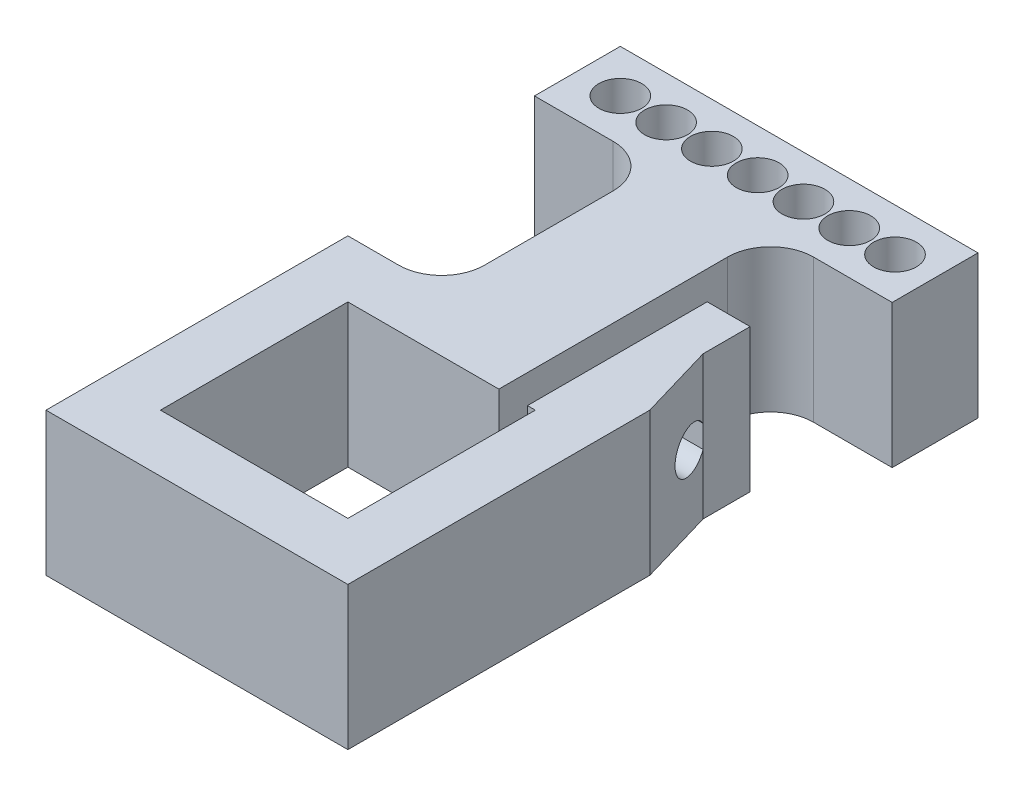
ISO-10303-21;
HEADER;
FILE_DESCRIPTION(('STEP AP214'),'2;1');
FILE_NAME('part.step','',(''),(''),'','','');
FILE_SCHEMA(('AUTOMOTIVE_DESIGN { 1 0 10303 214 1 1 1 1 }'));
ENDSEC;
DATA;
#1=APPLICATION_CONTEXT('core data for automotive mechanical design processes');
#2=APPLICATION_PROTOCOL_DEFINITION('international standard','automotive_design',2000,#1);
#3=PRODUCT_CONTEXT('',#1,'mechanical');
#4=PRODUCT('Part','Part','',(#3));
#5=PRODUCT_RELATED_PRODUCT_CATEGORY('part','',(#4));
#6=PRODUCT_DEFINITION_FORMATION('','',#4);
#7=PRODUCT_DEFINITION_CONTEXT('part definition',#1,'design');
#8=PRODUCT_DEFINITION('design','',#6,#7);
#9=PRODUCT_DEFINITION_SHAPE('','',#8);
#10=(LENGTH_UNIT() NAMED_UNIT(*) SI_UNIT(.MILLI.,.METRE.));
#11=(NAMED_UNIT(*) PLANE_ANGLE_UNIT() SI_UNIT($,.RADIAN.));
#12=(NAMED_UNIT(*) SI_UNIT($,.STERADIAN.) SOLID_ANGLE_UNIT());
#13=UNCERTAINTY_MEASURE_WITH_UNIT(LENGTH_MEASURE(1.E-05),#10,'distance_accuracy_value','');
#14=(GEOMETRIC_REPRESENTATION_CONTEXT(3) GLOBAL_UNCERTAINTY_ASSIGNED_CONTEXT((#13)) GLOBAL_UNIT_ASSIGNED_CONTEXT((#10,
#11,#12)) REPRESENTATION_CONTEXT('',''));
#15=CARTESIAN_POINT('',(0.,0.,0.));
#16=DIRECTION('',(0.,0.,1.));
#17=DIRECTION('',(1.,0.,0.));
#18=AXIS2_PLACEMENT_3D('',#15,#16,#17);
#19=CARTESIAN_POINT('',(1.,10.,0.));
#20=DIRECTION('',(-1.,0.,0.));
#21=DIRECTION('',(0.,0.,1.));
#22=AXIS2_PLACEMENT_3D('',#19,#20,#21);
#23=PLANE('',#22);
#24=DIRECTION('',(0.,0.,-1.));
#25=VECTOR('',#24,1.);
#26=CARTESIAN_POINT('',(1.,0.,0.));
#27=LINE('',#26,#25);
#28=CARTESIAN_POINT('',(1.,0.,-6.08729425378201));
#29=VERTEX_POINT('',#28);
#30=CARTESIAN_POINT('',(1.,0.,-18.6508880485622));
#31=VERTEX_POINT('',#30);
#32=EDGE_CURVE('E322',#29,#31,#27,.T.);
#33=ORIENTED_EDGE('',*,*,#32,.F.);
#34=DIRECTION('',(0.,-1.,0.));
#35=VECTOR('',#34,1.);
#36=CARTESIAN_POINT('',(1.,10.,-6.08729425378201));
#37=LINE('',#36,#35);
#38=CARTESIAN_POINT('',(1.,10.,-6.08729425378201));
#39=VERTEX_POINT('',#38);
#40=EDGE_CURVE('E466',#39,#29,#37,.T.);
#41=ORIENTED_EDGE('',*,*,#40,.F.);
#42=DIRECTION('',(0.,0.,-1.));
#43=VECTOR('',#42,1.);
#44=CARTESIAN_POINT('',(1.,10.,0.));
#45=LINE('',#44,#43);
#46=CARTESIAN_POINT('',(1.,10.,-18.6508880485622));
#47=VERTEX_POINT('',#46);
#48=EDGE_CURVE('E277',#39,#47,#45,.T.);
#49=ORIENTED_EDGE('',*,*,#48,.T.);
#50=DIRECTION('',(0.,-1.,0.));
#51=VECTOR('',#50,1.);
#52=CARTESIAN_POINT('',(1.,10.,-18.6508880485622));
#53=LINE('',#52,#51);
#54=EDGE_CURVE('E267',#47,#31,#53,.T.);
#55=ORIENTED_EDGE('',*,*,#54,.T.);
#56=EDGE_LOOP('',(#33,#41,#49,#55));
#57=FACE_BOUND('',#56,.T.);
#58=DIRECTION('',(0.,-1.,0.));
#59=VECTOR('',#58,1.);
#60=CARTESIAN_POINT('',(1.,10.,-15.3628000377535));
#61=LINE('',#60,#59);
#62=CARTESIAN_POINT('',(1.,5.78935733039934,-15.3628000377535));
#63=VERTEX_POINT('',#62);
#64=CARTESIAN_POINT('',(1.,4.21064266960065,-15.3628000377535));
#65=VERTEX_POINT('',#64);
#66=EDGE_CURVE('E325',#63,#65,#61,.T.);
#67=ORIENTED_EDGE('',*,*,#66,.F.);
#68=CARTESIAN_POINT('',(1.,5.,-14.087294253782));
#69=DIRECTION('',(-1.,0.,0.));
#70=DIRECTION('',(0.,0.,1.));
#71=AXIS2_PLACEMENT_3D('',#68,#69,#70);
#72=CIRCLE('',#71,1.5);
#73=EDGE_CURVE('E247',#63,#65,#72,.F.);
#74=ORIENTED_EDGE('',*,*,#73,.T.);
#75=EDGE_LOOP('',(#67,#74));
#76=FACE_BOUND('',#75,.T.);
#77=ADVANCED_FACE('F37',(#57,#76),#23,.T.);
#78=CARTESIAN_POINT('',(-0.999999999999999,10.,0.));
#79=DIRECTION('',(1.,0.,0.));
#80=DIRECTION('',(0.,0.,-1.));
#81=AXIS2_PLACEMENT_3D('',#78,#79,#80);
#82=PLANE('',#81);
#83=DIRECTION('',(0.,0.,1.));
#84=VECTOR('',#83,1.);
#85=CARTESIAN_POINT('',(-0.999999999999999,0.,0.));
#86=LINE('',#85,#84);
#87=CARTESIAN_POINT('',(-1.,0.,-22.077294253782));
#88=VERTEX_POINT('',#87);
#89=CARTESIAN_POINT('',(-1.,0.,-6.08729425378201));
#90=VERTEX_POINT('',#89);
#91=EDGE_CURVE('E308',#88,#90,#86,.T.);
#92=ORIENTED_EDGE('',*,*,#91,.F.);
#93=DIRECTION('',(0.,-1.,0.));
#94=VECTOR('',#93,1.);
#95=CARTESIAN_POINT('',(-1.,10.,-22.077294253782));
#96=LINE('',#95,#94);
#97=CARTESIAN_POINT('',(-1.,10.,-22.077294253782));
#98=VERTEX_POINT('',#97);
#99=EDGE_CURVE('E620',#88,#98,#96,.F.);
#100=ORIENTED_EDGE('',*,*,#99,.T.);
#101=DIRECTION('',(0.,0.,1.));
#102=VECTOR('',#101,1.);
#103=CARTESIAN_POINT('',(-0.999999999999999,10.,0.));
#104=LINE('',#103,#102);
#105=CARTESIAN_POINT('',(-1.,10.,-6.08729425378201));
#106=VERTEX_POINT('',#105);
#107=EDGE_CURVE('E353',#98,#106,#104,.T.);
#108=ORIENTED_EDGE('',*,*,#107,.T.);
#109=DIRECTION('',(0.,-1.,0.));
#110=VECTOR('',#109,1.);
#111=CARTESIAN_POINT('',(-1.,10.,-6.08729425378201));
#112=LINE('',#111,#110);
#113=EDGE_CURVE('E499',#106,#90,#112,.T.);
#114=ORIENTED_EDGE('',*,*,#113,.T.);
#115=EDGE_LOOP('',(#92,#100,#108,#114));
#116=FACE_BOUND('',#115,.T.);
#117=DIRECTION('',(0.,1.,0.));
#118=VECTOR('',#117,1.);
#119=CARTESIAN_POINT('',(-1.,10.,-15.3628000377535));
#120=LINE('',#119,#118);
#121=CARTESIAN_POINT('',(-1.,4.21064266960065,-15.3628000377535));
#122=VERTEX_POINT('',#121);
#123=CARTESIAN_POINT('',(-1.,5.78935733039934,-15.3628000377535));
#124=VERTEX_POINT('',#123);
#125=EDGE_CURVE('E369',#122,#124,#120,.T.);
#126=ORIENTED_EDGE('',*,*,#125,.F.);
#127=CARTESIAN_POINT('',(-1.,5.,-14.087294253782));
#128=DIRECTION('',(1.,0.,0.));
#129=DIRECTION('',(0.,0.,-1.));
#130=AXIS2_PLACEMENT_3D('',#127,#128,#129);
#131=CIRCLE('',#130,1.5);
#132=EDGE_CURVE('E376',#122,#124,#131,.F.);
#133=ORIENTED_EDGE('',*,*,#132,.T.);
#134=EDGE_LOOP('',(#126,#133));
#135=FACE_BOUND('',#134,.T.);
#136=ADVANCED_FACE('F576',(#116,#135),#82,.T.);
#137=CARTESIAN_POINT('',(-9.00000000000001,10.,0.));
#138=DIRECTION('',(1.,0.,0.));
#139=DIRECTION('',(0.,0.,-1.));
#140=AXIS2_PLACEMENT_3D('',#137,#138,#139);
#141=PLANE('',#140);
#142=DIRECTION('',(0.,0.,1.));
#143=VECTOR('',#142,1.);
#144=CARTESIAN_POINT('',(-9.00000000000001,10.,0.));
#145=LINE('',#144,#143);
#146=CARTESIAN_POINT('',(-8.99999999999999,10.,-22.077294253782));
#147=VERTEX_POINT('',#146);
#148=CARTESIAN_POINT('',(-9.,10.,-13.087294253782));
#149=VERTEX_POINT('',#148);
#150=EDGE_CURVE('E340',#147,#149,#145,.T.);
#151=ORIENTED_EDGE('',*,*,#150,.F.);
#152=DIRECTION('',(0.,-1.,0.));
#153=VECTOR('',#152,1.);
#154=CARTESIAN_POINT('',(-8.99999999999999,0.,-22.077294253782));
#155=LINE('',#154,#153);
#156=CARTESIAN_POINT('',(-8.99999999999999,0.,-22.077294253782));
#157=VERTEX_POINT('',#156);
#158=EDGE_CURVE('E616',#147,#157,#155,.T.);
#159=ORIENTED_EDGE('',*,*,#158,.T.);
#160=DIRECTION('',(0.,0.,1.));
#161=VECTOR('',#160,1.);
#162=CARTESIAN_POINT('',(-9.00000000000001,0.,0.));
#163=LINE('',#162,#161);
#164=CARTESIAN_POINT('',(-9.,0.,-13.087294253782));
#165=VERTEX_POINT('',#164);
#166=EDGE_CURVE('E295',#157,#165,#163,.T.);
#167=ORIENTED_EDGE('',*,*,#166,.T.);
#168=DIRECTION('',(0.,-1.,0.));
#169=VECTOR('',#168,1.);
#170=CARTESIAN_POINT('',(-9.,10.,-13.087294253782));
#171=LINE('',#170,#169);
#172=CARTESIAN_POINT('',(-9.,3.8819660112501,-13.087294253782));
#173=VERTEX_POINT('',#172);
#174=EDGE_CURVE('E636',#165,#173,#171,.F.);
#175=ORIENTED_EDGE('',*,*,#174,.T.);
#176=CARTESIAN_POINT('',(-9.,5.,-14.087294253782));
#177=DIRECTION('',(1.,0.,0.));
#178=DIRECTION('',(0.,0.,-1.));
#179=AXIS2_PLACEMENT_3D('',#176,#177,#178);
#180=CIRCLE('',#179,1.5);
#181=CARTESIAN_POINT('',(-9.,4.21064266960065,-15.3628000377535));
#182=VERTEX_POINT('',#181);
#183=EDGE_CURVE('E379',#182,#173,#180,.F.);
#184=ORIENTED_EDGE('',*,*,#183,.F.);
#185=DIRECTION('',(0.,1.,0.));
#186=VECTOR('',#185,1.);
#187=CARTESIAN_POINT('',(-9.,10.,-15.3628000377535));
#188=LINE('',#187,#186);
#189=CARTESIAN_POINT('',(-9.,5.78935733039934,-15.3628000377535));
#190=VERTEX_POINT('',#189);
#191=EDGE_CURVE('E372',#182,#190,#188,.T.);
#192=ORIENTED_EDGE('',*,*,#191,.T.);
#193=CARTESIAN_POINT('',(-9.,6.11803398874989,-13.087294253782));
#194=VERTEX_POINT('',#193);
#195=EDGE_CURVE('E255',#194,#190,#180,.F.);
#196=ORIENTED_EDGE('',*,*,#195,.F.);
#197=DIRECTION('',(0.,-1.,0.));
#198=VECTOR('',#197,1.);
#199=CARTESIAN_POINT('',(-9.,10.,-13.087294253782));
#200=LINE('',#199,#198);
#201=EDGE_CURVE('E680',#194,#149,#200,.F.);
#202=ORIENTED_EDGE('',*,*,#201,.T.);
#203=EDGE_LOOP('',(#151,#159,#167,#175,#184,#192,#196,#202));
#204=FACE_BOUND('',#203,.T.);
#205=ADVANCED_FACE('F536',(#204),#141,.F.);
#206=CARTESIAN_POINT('',(0.,10.,-6.08729425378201));
#207=DIRECTION('',(0.,0.,-1.));
#208=DIRECTION('',(-1.,0.,0.));
#209=AXIS2_PLACEMENT_3D('',#206,#207,#208);
#210=PLANE('',#209);
#211=DIRECTION('',(1.,0.,0.));
#212=VECTOR('',#211,1.);
#213=CARTESIAN_POINT('',(0.,0.,-6.08729425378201));
#214=LINE('',#213,#212);
#215=CARTESIAN_POINT('',(1.55,0.,-6.08729425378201));
#216=VERTEX_POINT('',#215);
#217=EDGE_CURVE('E319',#29,#216,#214,.T.);
#218=ORIENTED_EDGE('',*,*,#217,.T.);
#219=DIRECTION('',(0.,-1.,0.));
#220=VECTOR('',#219,1.);
#221=CARTESIAN_POINT('',(1.55,10.,-6.08729425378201));
#222=LINE('',#221,#220);
#223=CARTESIAN_POINT('',(1.55,10.,-6.08729425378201));
#224=VERTEX_POINT('',#223);
#225=EDGE_CURVE('E470',#224,#216,#222,.T.);
#226=ORIENTED_EDGE('',*,*,#225,.F.);
#227=DIRECTION('',(1.,0.,0.));
#228=VECTOR('',#227,1.);
#229=CARTESIAN_POINT('',(0.,10.,-6.08729425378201));
#230=LINE('',#229,#228);
#231=EDGE_CURVE('E364',#39,#224,#230,.T.);
#232=ORIENTED_EDGE('',*,*,#231,.F.);
#233=ORIENTED_EDGE('',*,*,#40,.T.);
#234=EDGE_LOOP('',(#218,#226,#232,#233));
#235=FACE_BOUND('',#234,.T.);
#236=ADVANCED_FACE('F472',(#235),#210,.F.);
#237=CARTESIAN_POINT('',(1.55,10.,0.));
#238=DIRECTION('',(-1.,0.,0.));
#239=DIRECTION('',(0.,0.,1.));
#240=AXIS2_PLACEMENT_3D('',#237,#238,#239);
#241=PLANE('',#240);
#242=DIRECTION('',(0.,0.,-1.));
#243=VECTOR('',#242,1.);
#244=CARTESIAN_POINT('',(1.55,0.,0.));
#245=LINE('',#244,#243);
#246=CARTESIAN_POINT('',(1.55,0.,7.01270574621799));
#247=VERTEX_POINT('',#246);
#248=EDGE_CURVE('E316',#247,#216,#245,.T.);
#249=ORIENTED_EDGE('',*,*,#248,.F.);
#250=DIRECTION('',(0.,-1.,0.));
#251=VECTOR('',#250,1.);
#252=CARTESIAN_POINT('',(1.55,10.,7.01270574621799));
#253=LINE('',#252,#251);
#254=CARTESIAN_POINT('',(1.55,10.,7.01270574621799));
#255=VERTEX_POINT('',#254);
#256=EDGE_CURVE('E475',#255,#247,#253,.T.);
#257=ORIENTED_EDGE('',*,*,#256,.F.);
#258=DIRECTION('',(0.,0.,-1.));
#259=VECTOR('',#258,1.);
#260=CARTESIAN_POINT('',(1.55,10.,0.));
#261=LINE('',#260,#259);
#262=EDGE_CURVE('E361',#255,#224,#261,.T.);
#263=ORIENTED_EDGE('',*,*,#262,.T.);
#264=ORIENTED_EDGE('',*,*,#225,.T.);
#265=EDGE_LOOP('',(#249,#257,#263,#264));
#266=FACE_BOUND('',#265,.T.);
#267=ADVANCED_FACE('F477',(#266),#241,.T.);
#268=CARTESIAN_POINT('',(0.,10.,7.01270574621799));
#269=DIRECTION('',(0.,0.,-1.));
#270=DIRECTION('',(-1.,0.,0.));
#271=AXIS2_PLACEMENT_3D('',#268,#269,#270);
#272=PLANE('',#271);
#273=DIRECTION('',(1.,0.,0.));
#274=VECTOR('',#273,1.);
#275=CARTESIAN_POINT('',(0.,0.,7.01270574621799));
#276=LINE('',#275,#274);
#277=CARTESIAN_POINT('',(-11.55,0.,7.01270574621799));
#278=VERTEX_POINT('',#277);
#279=EDGE_CURVE('E313',#278,#247,#276,.T.);
#280=ORIENTED_EDGE('',*,*,#279,.F.);
#281=DIRECTION('',(0.,-1.,0.));
#282=VECTOR('',#281,1.);
#283=CARTESIAN_POINT('',(-11.55,10.,7.01270574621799));
#284=LINE('',#283,#282);
#285=CARTESIAN_POINT('',(-11.55,10.,7.01270574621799));
#286=VERTEX_POINT('',#285);
#287=EDGE_CURVE('E482',#286,#278,#284,.T.);
#288=ORIENTED_EDGE('',*,*,#287,.F.);
#289=DIRECTION('',(1.,0.,0.));
#290=VECTOR('',#289,1.);
#291=CARTESIAN_POINT('',(0.,10.,7.01270574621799));
#292=LINE('',#291,#290);
#293=EDGE_CURVE('E358',#286,#255,#292,.T.);
#294=ORIENTED_EDGE('',*,*,#293,.T.);
#295=ORIENTED_EDGE('',*,*,#256,.T.);
#296=EDGE_LOOP('',(#280,#288,#294,#295));
#297=FACE_BOUND('',#296,.T.);
#298=ADVANCED_FACE('F481',(#297),#272,.T.);
#299=CARTESIAN_POINT('',(-11.55,10.,0.));
#300=DIRECTION('',(-1.,0.,0.));
#301=DIRECTION('',(0.,0.,1.));
#302=AXIS2_PLACEMENT_3D('',#299,#300,#301);
#303=PLANE('',#302);
#304=DIRECTION('',(0.,0.,-1.));
#305=VECTOR('',#304,1.);
#306=CARTESIAN_POINT('',(-11.55,0.,0.));
#307=LINE('',#306,#305);
#308=CARTESIAN_POINT('',(-11.55,0.,-6.08729425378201));
#309=VERTEX_POINT('',#308);
#310=EDGE_CURVE('E311',#278,#309,#307,.T.);
#311=ORIENTED_EDGE('',*,*,#310,.T.);
#312=DIRECTION('',(0.,-1.,0.));
#313=VECTOR('',#312,1.);
#314=CARTESIAN_POINT('',(-11.55,10.,-6.08729425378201));
#315=LINE('',#314,#313);
#316=CARTESIAN_POINT('',(-11.55,10.,-6.08729425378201));
#317=VERTEX_POINT('',#316);
#318=EDGE_CURVE('E486',#317,#309,#315,.T.);
#319=ORIENTED_EDGE('',*,*,#318,.F.);
#320=DIRECTION('',(0.,0.,-1.));
#321=VECTOR('',#320,1.);
#322=CARTESIAN_POINT('',(-11.55,10.,0.));
#323=LINE('',#322,#321);
#324=EDGE_CURVE('E356',#286,#317,#323,.T.);
#325=ORIENTED_EDGE('',*,*,#324,.F.);
#326=ORIENTED_EDGE('',*,*,#287,.T.);
#327=EDGE_LOOP('',(#311,#319,#325,#326));
#328=FACE_BOUND('',#327,.T.);
#329=ADVANCED_FACE('F489',(#328),#303,.F.);
#330=EDGE_CURVE('E310',#309,#90,#214,.T.);
#331=ORIENTED_EDGE('',*,*,#330,.T.);
#332=ORIENTED_EDGE('',*,*,#113,.F.);
#333=EDGE_CURVE('E355',#317,#106,#230,.T.);
#334=ORIENTED_EDGE('',*,*,#333,.F.);
#335=ORIENTED_EDGE('',*,*,#318,.T.);
#336=EDGE_LOOP('',(#331,#332,#334,#335));
#337=FACE_BOUND('',#336,.T.);
#338=ADVANCED_FACE('F500',(#337),#210,.F.);
#339=CARTESIAN_POINT('',(0.,10.,-25.077294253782));
#340=DIRECTION('',(0.,0.,-1.));
#341=DIRECTION('',(-1.,0.,0.));
#342=AXIS2_PLACEMENT_3D('',#339,#340,#341);
#343=PLANE('',#342);
#344=DIRECTION('',(1.,0.,0.));
#345=VECTOR('',#344,1.);
#346=CARTESIAN_POINT('',(0.,10.,-25.077294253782));
#347=LINE('',#346,#345);
#348=CARTESIAN_POINT('',(2.,10.,-25.077294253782));
#349=VERTEX_POINT('',#348);
#350=CARTESIAN_POINT('',(7.5,10.,-25.077294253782));
#351=VERTEX_POINT('',#350);
#352=EDGE_CURVE('E351',#349,#351,#347,.T.);
#353=ORIENTED_EDGE('',*,*,#352,.F.);
#354=DIRECTION('',(0.,-1.,0.));
#355=VECTOR('',#354,1.);
#356=CARTESIAN_POINT('',(2.,10.,-25.077294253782));
#357=LINE('',#356,#355);
#358=CARTESIAN_POINT('',(2.,0.,-25.077294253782));
#359=VERTEX_POINT('',#358);
#360=EDGE_CURVE('E559',#349,#359,#357,.T.);
#361=ORIENTED_EDGE('',*,*,#360,.T.);
#362=DIRECTION('',(1.,0.,0.));
#363=VECTOR('',#362,1.);
#364=CARTESIAN_POINT('',(0.,0.,-25.077294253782));
#365=LINE('',#364,#363);
#366=CARTESIAN_POINT('',(7.5,0.,-25.077294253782));
#367=VERTEX_POINT('',#366);
#368=EDGE_CURVE('E306',#359,#367,#365,.T.);
#369=ORIENTED_EDGE('',*,*,#368,.T.);
#370=DIRECTION('',(0.,-1.,0.));
#371=VECTOR('',#370,1.);
#372=CARTESIAN_POINT('',(7.5,10.,-25.077294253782));
#373=LINE('',#372,#371);
#374=EDGE_CURVE('E504',#351,#367,#373,.T.);
#375=ORIENTED_EDGE('',*,*,#374,.F.);
#376=EDGE_LOOP('',(#353,#361,#369,#375));
#377=FACE_BOUND('',#376,.T.);
#378=ADVANCED_FACE('F589',(#377),#343,.F.);
#379=CARTESIAN_POINT('',(7.5,10.,0.));
#380=DIRECTION('',(1.,0.,0.));
#381=DIRECTION('',(0.,0.,-1.));
#382=AXIS2_PLACEMENT_3D('',#379,#380,#381);
#383=PLANE('',#382);
#384=DIRECTION('',(0.,0.,1.));
#385=VECTOR('',#384,1.);
#386=CARTESIAN_POINT('',(7.5,0.,0.));
#387=LINE('',#386,#385);
#388=CARTESIAN_POINT('',(7.5,0.,-31.077294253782));
#389=VERTEX_POINT('',#388);
#390=EDGE_CURVE('E303',#389,#367,#387,.T.);
#391=ORIENTED_EDGE('',*,*,#390,.F.);
#392=DIRECTION('',(0.,-1.,0.));
#393=VECTOR('',#392,1.);
#394=CARTESIAN_POINT('',(7.5,10.,-31.077294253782));
#395=LINE('',#394,#393);
#396=CARTESIAN_POINT('',(7.5,10.,-31.077294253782));
#397=VERTEX_POINT('',#396);
#398=EDGE_CURVE('E508',#397,#389,#395,.T.);
#399=ORIENTED_EDGE('',*,*,#398,.F.);
#400=DIRECTION('',(0.,0.,1.));
#401=VECTOR('',#400,1.);
#402=CARTESIAN_POINT('',(7.5,10.,0.));
#403=LINE('',#402,#401);
#404=EDGE_CURVE('E348',#397,#351,#403,.T.);
#405=ORIENTED_EDGE('',*,*,#404,.T.);
#406=ORIENTED_EDGE('',*,*,#374,.T.);
#407=EDGE_LOOP('',(#391,#399,#405,#406));
#408=FACE_BOUND('',#407,.T.);
#409=ADVANCED_FACE('F593',(#408),#383,.T.);
#410=CARTESIAN_POINT('',(0.,10.,-31.077294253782));
#411=DIRECTION('',(0.,0.,1.));
#412=DIRECTION('',(1.,0.,0.));
#413=AXIS2_PLACEMENT_3D('',#410,#411,#412);
#414=PLANE('',#413);
#415=DIRECTION('',(-1.,0.,0.));
#416=VECTOR('',#415,1.);
#417=CARTESIAN_POINT('',(0.,0.,-31.077294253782));
#418=LINE('',#417,#416);
#419=CARTESIAN_POINT('',(-17.5,0.,-31.077294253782));
#420=VERTEX_POINT('',#419);
#421=EDGE_CURVE('E301',#389,#420,#418,.T.);
#422=ORIENTED_EDGE('',*,*,#421,.T.);
#423=DIRECTION('',(0.,-1.,0.));
#424=VECTOR('',#423,1.);
#425=CARTESIAN_POINT('',(-17.5,10.,-31.077294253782));
#426=LINE('',#425,#424);
#427=CARTESIAN_POINT('',(-17.5,10.,-31.077294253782));
#428=VERTEX_POINT('',#427);
#429=EDGE_CURVE('E669',#428,#420,#426,.T.);
#430=ORIENTED_EDGE('',*,*,#429,.F.);
#431=DIRECTION('',(-1.,0.,0.));
#432=VECTOR('',#431,1.);
#433=CARTESIAN_POINT('',(0.,10.,-31.077294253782));
#434=LINE('',#433,#432);
#435=EDGE_CURVE('E346',#397,#428,#434,.T.);
#436=ORIENTED_EDGE('',*,*,#435,.F.);
#437=ORIENTED_EDGE('',*,*,#398,.T.);
#438=EDGE_LOOP('',(#422,#430,#436,#437));
#439=FACE_BOUND('',#438,.T.);
#440=ADVANCED_FACE('F597',(#439),#414,.F.);
#441=CARTESIAN_POINT('',(-17.5,10.,0.));
#442=DIRECTION('',(1.,0.,0.));
#443=DIRECTION('',(0.,0.,-1.));
#444=AXIS2_PLACEMENT_3D('',#441,#442,#443);
#445=PLANE('',#444);
#446=DIRECTION('',(0.,0.,1.));
#447=VECTOR('',#446,1.);
#448=CARTESIAN_POINT('',(-17.5,0.,0.));
#449=LINE('',#448,#447);
#450=CARTESIAN_POINT('',(-17.5,0.,-25.077294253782));
#451=VERTEX_POINT('',#450);
#452=EDGE_CURVE('E299',#420,#451,#449,.T.);
#453=ORIENTED_EDGE('',*,*,#452,.T.);
#454=DIRECTION('',(0.,-1.,0.));
#455=VECTOR('',#454,1.);
#456=CARTESIAN_POINT('',(-17.5,10.,-25.077294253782));
#457=LINE('',#456,#455);
#458=CARTESIAN_POINT('',(-17.5,10.,-25.077294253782));
#459=VERTEX_POINT('',#458);
#460=EDGE_CURVE('E610',#459,#451,#457,.T.);
#461=ORIENTED_EDGE('',*,*,#460,.F.);
#462=DIRECTION('',(0.,0.,1.));
#463=VECTOR('',#462,1.);
#464=CARTESIAN_POINT('',(-17.5,10.,0.));
#465=LINE('',#464,#463);
#466=EDGE_CURVE('E344',#428,#459,#465,.T.);
#467=ORIENTED_EDGE('',*,*,#466,.F.);
#468=ORIENTED_EDGE('',*,*,#429,.T.);
#469=EDGE_LOOP('',(#453,#461,#467,#468));
#470=FACE_BOUND('',#469,.T.);
#471=ADVANCED_FACE('F601',(#470),#445,.F.);
#472=CARTESIAN_POINT('',(0.,10.,-25.077294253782));
#473=DIRECTION('',(0.,0.,-1.));
#474=DIRECTION('',(-1.,0.,0.));
#475=AXIS2_PLACEMENT_3D('',#472,#473,#474);
#476=PLANE('',#475);
#477=DIRECTION('',(1.,0.,0.));
#478=VECTOR('',#477,1.);
#479=CARTESIAN_POINT('',(0.,0.,-25.077294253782));
#480=LINE('',#479,#478);
#481=CARTESIAN_POINT('',(-12.,0.,-25.077294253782));
#482=VERTEX_POINT('',#481);
#483=EDGE_CURVE('E297',#451,#482,#480,.T.);
#484=ORIENTED_EDGE('',*,*,#483,.T.);
#485=DIRECTION('',(0.,-1.,0.));
#486=VECTOR('',#485,1.);
#487=CARTESIAN_POINT('',(-12.,10.,-25.077294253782));
#488=LINE('',#487,#486);
#489=CARTESIAN_POINT('',(-12.,10.,-25.077294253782));
#490=VERTEX_POINT('',#489);
#491=EDGE_CURVE('E52',#482,#490,#488,.F.);
#492=ORIENTED_EDGE('',*,*,#491,.T.);
#493=DIRECTION('',(1.,0.,0.));
#494=VECTOR('',#493,1.);
#495=CARTESIAN_POINT('',(0.,10.,-25.077294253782));
#496=LINE('',#495,#494);
#497=EDGE_CURVE('E342',#459,#490,#496,.T.);
#498=ORIENTED_EDGE('',*,*,#497,.F.);
#499=ORIENTED_EDGE('',*,*,#460,.T.);
#500=EDGE_LOOP('',(#484,#492,#498,#499));
#501=FACE_BOUND('',#500,.T.);
#502=ADVANCED_FACE('F533',(#501),#476,.F.);
#503=CARTESIAN_POINT('',(0.,10.,-10.087294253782));
#504=DIRECTION('',(0.,0.,-1.));
#505=DIRECTION('',(-1.,0.,0.));
#506=AXIS2_PLACEMENT_3D('',#503,#504,#505);
#507=PLANE('',#506);
#508=DIRECTION('',(1.,0.,0.));
#509=VECTOR('',#508,1.);
#510=CARTESIAN_POINT('',(0.,10.,-10.087294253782));
#511=LINE('',#510,#509);
#512=CARTESIAN_POINT('',(-15.55,10.,-10.087294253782));
#513=VERTEX_POINT('',#512);
#514=CARTESIAN_POINT('',(-12.,10.,-10.087294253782));
#515=VERTEX_POINT('',#514);
#516=EDGE_CURVE('E337',#513,#515,#511,.T.);
#517=ORIENTED_EDGE('',*,*,#516,.T.);
#518=DIRECTION('',(0.,-1.,0.));
#519=VECTOR('',#518,1.);
#520=CARTESIAN_POINT('',(-12.,10.,-10.087294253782));
#521=LINE('',#520,#519);
#522=CARTESIAN_POINT('',(-12.,6.11803398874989,-10.087294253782));
#523=VERTEX_POINT('',#522);
#524=EDGE_CURVE('E521',#515,#523,#521,.T.);
#525=ORIENTED_EDGE('',*,*,#524,.T.);
#526=CARTESIAN_POINT('',(-9.,3.64782450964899,-13.4379704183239));
#527=CARTESIAN_POINT('',(-8.61765824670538,3.74448502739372,-10.087294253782));
#528=CARTESIAN_POINT('',(-11.8885542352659,2.91756383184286,-10.087294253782));
#529=CARTESIAN_POINT('',(-9.,3.65457893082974,-13.4239518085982));
#530=CARTESIAN_POINT('',(-8.63306447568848,3.74045044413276,-10.087294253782));
#531=CARTESIAN_POINT('',(-11.9025434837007,2.97287473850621,-10.087294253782));
#532=CARTESIAN_POINT('',(-9.,3.66198301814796,-13.4090490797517));
#533=CARTESIAN_POINT('',(-8.64977329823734,3.73774799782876,-10.087294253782));
#534=CARTESIAN_POINT('',(-11.9151133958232,3.02853802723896,-10.087294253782));
#535=CARTESIAN_POINT('',(-9.,3.67859917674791,-13.3771961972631));
#536=CARTESIAN_POINT('',(-8.6857617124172,3.73583935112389,-10.087294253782));
#537=CARTESIAN_POINT('',(-11.9375026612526,3.14039520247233,-10.087294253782));
#538=CARTESIAN_POINT('',(-9.,3.68781059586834,-13.3602467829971));
#539=CARTESIAN_POINT('',(-8.70501253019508,3.73661203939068,-10.087294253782));
#540=CARTESIAN_POINT('',(-11.9473230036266,3.19658889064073,-10.087294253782));
#541=CARTESIAN_POINT('',(-9.,3.70846151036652,-13.3241735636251));
#542=CARTESIAN_POINT('',(-8.74588992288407,3.74236458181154,-10.087294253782));
#543=CARTESIAN_POINT('',(-11.9642352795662,3.30886881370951,-10.087294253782));
#544=CARTESIAN_POINT('',(-9.,3.71988035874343,-13.3050705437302));
#545=CARTESIAN_POINT('',(-8.76746045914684,3.74727727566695,-10.087294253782));
#546=CARTESIAN_POINT('',(-11.9713508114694,3.36495152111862,-10.087294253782));
#547=CARTESIAN_POINT('',(-9.,3.74571375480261,-13.2642806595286));
#548=CARTESIAN_POINT('',(-8.81301557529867,3.76215770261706,-10.087294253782));
#549=CARTESIAN_POINT('',(-11.9831183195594,3.47737717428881,-10.087294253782));
#550=CARTESIAN_POINT('',(-9.,3.76012855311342,-13.242593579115));
#551=CARTESIAN_POINT('',(-8.83696389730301,3.77208312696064,-10.087294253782));
#552=CARTESIAN_POINT('',(-11.9877700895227,3.5337201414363,-10.087294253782));
#553=CARTESIAN_POINT('',(-9.,3.79289810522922,-13.1963908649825));
#554=CARTESIAN_POINT('',(-8.88705395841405,3.798022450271,-10.087294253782));
#555=CARTESIAN_POINT('',(-11.9947997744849,3.64654303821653,-10.087294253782));
#556=CARTESIAN_POINT('',(-9.,3.81125274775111,-13.1718753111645));
#557=CARTESIAN_POINT('',(-8.91315600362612,3.8139760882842,-10.087294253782));
#558=CARTESIAN_POINT('',(-11.997177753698,3.70302296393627,-10.087294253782));
#559=CARTESIAN_POINT('',(-9.,3.85315497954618,-13.1198938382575));
#560=CARTESIAN_POINT('',(-8.9671485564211,3.85315398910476,-10.087294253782));
#561=CARTESIAN_POINT('',(-11.9999164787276,3.81602498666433,-10.087294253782));
#562=CARTESIAN_POINT('',(-9.,3.8767022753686,-13.0924280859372));
#563=CARTESIAN_POINT('',(-8.99499956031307,3.87629695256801,-10.087294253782));
#564=CARTESIAN_POINT('',(-12.0002773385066,3.87254708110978,-10.087294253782));
#565=CARTESIAN_POINT('',(-9.,3.93065668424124,-13.0346435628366));
#566=CARTESIAN_POINT('',(-9.05186907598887,3.93119952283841,-10.087294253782));
#567=CARTESIAN_POINT('',(-11.9993187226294,3.9856966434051,-10.087294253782));
#568=CARTESIAN_POINT('',(-9.,3.96107866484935,-13.0043186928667));
#569=CARTESIAN_POINT('',(-9.08085786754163,3.96287562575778,-10.087294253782));
#570=CARTESIAN_POINT('',(-11.9979955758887,4.04232407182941,-10.087294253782));
#571=CARTESIAN_POINT('',(-9.,4.0307139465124,-12.9415699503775));
#572=CARTESIAN_POINT('',(-9.13886246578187,4.03611451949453,-10.087294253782));
#573=CARTESIAN_POINT('',(-11.9941017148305,4.15554238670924,-10.087294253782));
#574=CARTESIAN_POINT('',(-9.,4.0699288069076,-12.9091457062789));
#575=CARTESIAN_POINT('',(-9.16786323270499,4.07756178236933,-10.087294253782));
#576=CARTESIAN_POINT('',(-11.9915307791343,4.21213326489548,-10.087294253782));
#577=CARTESIAN_POINT('',(-9.,4.15354526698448,-12.8480047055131));
#578=CARTESIAN_POINT('',(-9.22071393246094,4.16544638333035,-10.087294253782));
#579=CARTESIAN_POINT('',(-11.9860650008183,4.31811990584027,-10.087294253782));
#580=CARTESIAN_POINT('',(-9.,4.19666305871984,-12.8193378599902));
#581=CARTESIAN_POINT('',(-9.24473385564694,4.21046236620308,-10.087294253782));
#582=CARTESIAN_POINT('',(-11.983252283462,4.36752019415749,-10.087294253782));
#583=CARTESIAN_POINT('',(-9.,4.2922109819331,-12.7636298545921));
#584=CARTESIAN_POINT('',(-9.29007584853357,4.30895710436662,-10.087294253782));
#585=CARTESIAN_POINT('',(-11.9775350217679,4.46631694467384,-10.087294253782));
#586=CARTESIAN_POINT('',(-9.,4.3446414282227,-12.736588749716));
#587=CARTESIAN_POINT('',(-9.31143402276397,4.36239471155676,-10.087294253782));
#588=CARTESIAN_POINT('',(-11.9746304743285,4.51571340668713,-10.087294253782));
#589=CARTESIAN_POINT('',(-9.,4.45892312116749,-12.6869013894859));
#590=CARTESIAN_POINT('',(-9.34971060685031,4.47708922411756,-10.087294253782));
#591=CARTESIAN_POINT('',(-11.969202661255,4.61449912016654,-10.087294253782));
#592=CARTESIAN_POINT('',(-9.,4.52076876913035,-12.6642525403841));
#593=CARTESIAN_POINT('',(-9.36669010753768,4.53836247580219,-10.087294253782));
#594=CARTESIAN_POINT('',(-11.9666791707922,4.6638883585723,-10.087294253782));
#595=CARTESIAN_POINT('',(-9.,4.65242706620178,-12.6265199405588));
#596=CARTESIAN_POINT('',(-9.39447806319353,4.66701416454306,-10.087294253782));
#597=CARTESIAN_POINT('',(-11.9624574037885,4.76270185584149,-10.087294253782));
#598=CARTESIAN_POINT('',(-9.,4.72223931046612,-12.6114358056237));
#599=CARTESIAN_POINT('',(-9.40535149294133,4.73450253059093,-10.087294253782));
#600=CARTESIAN_POINT('',(-11.9607590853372,4.81212611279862,-10.087294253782));
#601=CARTESIAN_POINT('',(-9.,4.86635072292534,-12.5914962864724));
#602=CARTESIAN_POINT('',(-9.4196112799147,4.87263841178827,-10.087294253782));
#603=CARTESIAN_POINT('',(-11.9585135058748,4.91098456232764,-10.087294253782));
#604=CARTESIAN_POINT('',(-9.,4.94064824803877,-12.5866371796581));
#605=CARTESIAN_POINT('',(-9.42304262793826,4.94347831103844,-10.087294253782));
#606=CARTESIAN_POINT('',(-11.9579658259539,4.96041874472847,-10.087294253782));
#607=CARTESIAN_POINT('',(-9.,5.08890610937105,-12.5880969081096));
#608=CARTESIAN_POINT('',(-9.42200839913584,5.0846837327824,-10.087294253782));
#609=CARTESIAN_POINT('',(-11.9581303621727,5.05928511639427,-10.087294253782));
#610=CARTESIAN_POINT('',(-9.,5.16286644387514,-12.5944158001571));
#611=CARTESIAN_POINT('',(-9.41753948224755,5.15527460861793,-10.087294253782));
#612=CARTESIAN_POINT('',(-11.9588425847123,5.10871730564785,-10.087294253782));
#613=CARTESIAN_POINT('',(-9.,5.3057735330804,-12.6170026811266));
#614=CARTESIAN_POINT('',(-9.40134087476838,5.29251714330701,-10.087294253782));
#615=CARTESIAN_POINT('',(-11.9613853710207,5.20759257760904,-10.087294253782));
#616=CARTESIAN_POINT('',(-9.,5.3747160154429,-12.6332790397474));
#617=CARTESIAN_POINT('',(-9.38955806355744,5.3593501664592,-10.087294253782));
#618=CARTESIAN_POINT('',(-11.963216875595,5.25703563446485,-10.087294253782));
#619=CARTESIAN_POINT('',(-9.,5.50431556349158,-12.6729818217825));
#620=CARTESIAN_POINT('',(-9.3601663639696,5.48640586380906,-10.087294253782));
#621=CARTESIAN_POINT('',(-11.9676509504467,5.35588707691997,-10.087294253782));
#622=CARTESIAN_POINT('',(-9.,5.56497227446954,-12.6964085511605));
#623=CARTESIAN_POINT('',(-9.34249179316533,5.54672612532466,-10.087294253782));
#624=CARTESIAN_POINT('',(-11.9702535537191,5.40529546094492,-10.087294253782));
#625=CARTESIAN_POINT('',(-9.,5.67663865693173,-12.7471724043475));
#626=CARTESIAN_POINT('',(-9.30311549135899,5.65921572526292,-10.087294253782));
#627=CARTESIAN_POINT('',(-11.9757684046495,5.50397403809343,-10.087294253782));
#628=CARTESIAN_POINT('',(-9.,5.72767130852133,-12.7744999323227));
#629=CARTESIAN_POINT('',(-9.28136737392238,5.71141639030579,-10.087294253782));
#630=CARTESIAN_POINT('',(-11.9786798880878,5.55324427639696,-10.087294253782));
#631=CARTESIAN_POINT('',(-9.,5.82057203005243,-12.8304694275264));
#632=CARTESIAN_POINT('',(-9.23546201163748,5.80747843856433,-10.087294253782));
#633=CARTESIAN_POINT('',(-11.9843515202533,5.65179292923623,-10.087294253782));
#634=CARTESIAN_POINT('',(-9.,5.86244028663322,-12.8591113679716));
#635=CARTESIAN_POINT('',(-9.21127225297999,5.85129314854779,-10.087294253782));
#636=CARTESIAN_POINT('',(-11.9871116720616,5.70107134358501,-10.087294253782));
#637=CARTESIAN_POINT('',(-9.,5.93807989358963,-12.9158673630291));
#638=CARTESIAN_POINT('',(-9.16186463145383,5.93085681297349,-10.087294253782));
#639=CARTESIAN_POINT('',(-11.9920526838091,5.79960614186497,-10.087294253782));
#640=CARTESIAN_POINT('',(-9.,5.97185982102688,-12.9439819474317));
#641=CARTESIAN_POINT('',(-9.13663912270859,5.96654162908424,-10.087294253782));
#642=CARTESIAN_POINT('',(-11.9942341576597,5.84886249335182,-10.087294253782));
#643=CARTESIAN_POINT('',(-9.,6.03273337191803,-12.9986553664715));
#644=CARTESIAN_POINT('',(-9.08615579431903,6.03057873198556,-10.087294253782));
#645=CARTESIAN_POINT('',(-11.9976603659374,5.94740724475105,-10.087294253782));
#646=CARTESIAN_POINT('',(-9.,6.05982734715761,-13.025214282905));
#647=CARTESIAN_POINT('',(-9.0609074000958,6.05885420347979,-10.087294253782));
#648=CARTESIAN_POINT('',(-11.9989051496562,5.99669564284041,-10.087294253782));
#649=CARTESIAN_POINT('',(-9.,6.10867089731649,-13.0763051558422));
#650=CARTESIAN_POINT('',(-9.01106164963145,6.10893508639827,-10.087294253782));
#651=CARTESIAN_POINT('',(-12.0001630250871,6.09536995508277,-10.087294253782));
#652=CARTESIAN_POINT('',(-9.,6.1304117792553,-13.1008337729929));
#653=CARTESIAN_POINT('',(-8.98648612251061,6.13065968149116,-10.087294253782));
#654=CARTESIAN_POINT('',(-12.0001741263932,6.14475589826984,-10.087294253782));
#655=CARTESIAN_POINT('',(-9.,6.16961166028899,-13.1476466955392));
#656=CARTESIAN_POINT('',(-8.93852489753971,6.16841265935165,-10.087294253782));
#657=CARTESIAN_POINT('',(-11.9987219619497,6.24350415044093,-10.087294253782));
#658=CARTESIAN_POINT('',(-9.,6.18707099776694,-13.1699311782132));
#659=CARTESIAN_POINT('',(-8.91516457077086,6.1843835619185,-10.087294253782));
#660=CARTESIAN_POINT('',(-11.9972588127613,6.29286646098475,-10.087294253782));
#661=CARTESIAN_POINT('',(-9.,6.21869506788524,-13.2123711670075));
#662=CARTESIAN_POINT('',(-8.86986848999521,6.21148346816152,-10.087294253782));
#663=CARTESIAN_POINT('',(-11.9926592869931,6.39171159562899,-10.087294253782));
#664=CARTESIAN_POINT('',(-9.,6.23284647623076,-13.2325178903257));
#665=CARTESIAN_POINT('',(-8.84796640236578,6.22254682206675,-10.087294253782));
#666=CARTESIAN_POINT('',(-11.9895163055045,6.4411941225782,-10.087294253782));
#667=CARTESIAN_POINT('',(-9.,6.25846513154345,-13.270733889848));
#668=CARTESIAN_POINT('',(-8.80586672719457,6.24043403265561,-10.087294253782));
#669=CARTESIAN_POINT('',(-11.981410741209,6.5400263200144,-10.087294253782));
#670=CARTESIAN_POINT('',(-9.,6.26993144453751,-13.2888024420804));
#671=CARTESIAN_POINT('',(-8.78569553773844,6.2472215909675,-10.087294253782));
#672=CARTESIAN_POINT('',(-11.9764475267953,6.58937593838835,-10.087294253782));
#673=CARTESIAN_POINT('',(-9.,6.28040045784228,-13.3059014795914));
#674=CARTESIAN_POINT('',(-8.76652932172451,6.25224625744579,-10.087294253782));
#675=CARTESIAN_POINT('',(-11.9705040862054,6.638613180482,-10.087294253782));
#676=(BOUNDED_SURFACE() B_SPLINE_SURFACE(3,2,((#526,#527,#528),(#529,#530,#531),(#532,#533,
#534),(#535,#536,#537),(#538,#539,#540),(#541,#542,#543),(#544,#545,#546),(#547,#548,#549),
(#550,#551,#552),(#553,#554,#555),(#556,#557,#558),(#559,#560,#561),(#562,#563,#564),(#565,#566,
#567),(#568,#569,#570),(#571,#572,#573),(#574,#575,#576),(#577,#578,#579),(#580,#581,#582),
(#583,#584,#585),(#586,#587,#588),(#589,#590,#591),(#592,#593,#594),(#595,#596,#597),(#598,#599,
#600),(#601,#602,#603),(#604,#605,#606),(#607,#608,#609),(#610,#611,#612),(#613,#614,#615),
(#616,#617,#618),(#619,#620,#621),(#622,#623,#624),(#625,#626,#627),(#628,#629,#630),(#631,#632,
#633),(#634,#635,#636),(#637,#638,#639),(#640,#641,#642),(#643,#644,#645),(#646,#647,#648),
(#649,#650,#651),(#652,#653,#654),(#655,#656,#657),(#658,#659,#660),(#661,#662,#663),(#664,#665,
#666),(#667,#668,#669),(#670,#671,#672),(#673,#674,#675)),.UNSPECIFIED.,.F.,.F.,
.F.) B_SPLINE_SURFACE_WITH_KNOTS((4,2,2,2,2,2,2,2,2,2,2,2,2,2,2,2,2,2,2,2,2,2,2,2,4),(3,3),(0.,
0.171129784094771,0.342197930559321,0.511737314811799,0.681290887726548,0.850839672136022,
1.02037887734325,1.19028830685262,1.36022789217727,1.50866832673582,1.65711378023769,
1.80547130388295,1.95382129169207,2.10211726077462,2.25041398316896,2.39883552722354,
2.54726342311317,2.6953322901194,2.84339814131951,2.99130627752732,3.13920662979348,
3.28734559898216,3.43547285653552,3.5841868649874,3.73295252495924),(0.,1.),
.UNSPECIFIED.) GEOMETRIC_REPRESENTATION_ITEM() RATIONAL_B_SPLINE_SURFACE(((1.,0.664495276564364,
1.),(1.,0.666253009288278,1.),(1.,0.668115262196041,1.),(1.,0.672076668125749,1.),(1.,
0.674175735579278,1.),(1.,0.678619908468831,1.),(1.,0.680962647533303,1.),(1.,0.685936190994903,
1.),(1.,0.688567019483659,1.),(1.,0.694136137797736,1.),(1.,0.697074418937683,1.),(1.,
0.703261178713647,1.),(1.,0.706509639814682,1.),(1.,0.713292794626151,1.),(1.,0.716828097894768,
1.),(1.,0.724085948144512,1.),(1.,0.727808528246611,1.),(1.,0.734773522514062,1.),(1.,
0.738017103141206,1.),(1.,0.744280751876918,1.),(1.,0.747300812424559,1.),(1.,0.752821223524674,
1.),(1.,0.755321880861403,1.),(1.,0.759473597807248,1.),(1.,0.761124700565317,1.),(1.,
0.763304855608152,1.),(1.,0.763834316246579,1.),(1.,0.763675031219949,1.),(1.,0.76298627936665,
1.),(1.,0.760515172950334,1.),(1.,0.758731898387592,1.),(1.,0.754358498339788,1.),(1.,
0.751768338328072,1.),(1.,0.746119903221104,1.),(1.,0.743062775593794,1.),(1.,0.736759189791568,
1.),(1.,0.733512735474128,1.),(1.,0.727036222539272,1.),(1.,0.723806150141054,1.),(1.,
0.717483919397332,1.),(1.,0.714391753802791,1.),(1.,0.708407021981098,1.),(1.,0.705514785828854,
1.),(1.,0.699963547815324,1.),(1.,0.697304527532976,1.),(1.,0.692214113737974,1.),(1.,
0.689783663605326,1.),(1.,0.685151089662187,1.),(1.,0.682949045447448,1.),(1.,0.680856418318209,1.))) REPRESENTATION_ITEM('') SURFACE());
#677=CARTESIAN_POINT('',(-11.9705040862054,6.638613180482,-10.087294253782));
#678=CARTESIAN_POINT('',(-11.9764475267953,6.58937593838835,-10.087294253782));
#679=CARTESIAN_POINT('',(-11.981410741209,6.5400263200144,-10.087294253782));
#680=CARTESIAN_POINT('',(-11.9895163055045,6.4411941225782,-10.087294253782));
#681=CARTESIAN_POINT('',(-11.9926592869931,6.39171159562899,-10.087294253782));
#682=CARTESIAN_POINT('',(-11.9972588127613,6.29286646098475,-10.087294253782));
#683=CARTESIAN_POINT('',(-11.9987219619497,6.24350415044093,-10.087294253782));
#684=CARTESIAN_POINT('',(-12.0001741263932,6.14475589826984,-10.087294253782));
#685=CARTESIAN_POINT('',(-12.0001630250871,6.09536995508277,-10.087294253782));
#686=CARTESIAN_POINT('',(-11.9989051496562,5.99669564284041,-10.087294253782));
#687=CARTESIAN_POINT('',(-11.9976603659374,5.94740724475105,-10.087294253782));
#688=CARTESIAN_POINT('',(-11.9942341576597,5.84886249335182,-10.087294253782));
#689=CARTESIAN_POINT('',(-11.9920526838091,5.79960614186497,-10.087294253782));
#690=CARTESIAN_POINT('',(-11.9871116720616,5.70107134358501,-10.087294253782));
#691=CARTESIAN_POINT('',(-11.9843515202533,5.65179292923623,-10.087294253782));
#692=CARTESIAN_POINT('',(-11.9786798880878,5.55324427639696,-10.087294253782));
#693=CARTESIAN_POINT('',(-11.9757684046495,5.50397403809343,-10.087294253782));
#694=CARTESIAN_POINT('',(-11.9702535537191,5.40529546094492,-10.087294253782));
#695=CARTESIAN_POINT('',(-11.9676509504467,5.35588707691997,-10.087294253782));
#696=CARTESIAN_POINT('',(-11.963216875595,5.25703563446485,-10.087294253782));
#697=CARTESIAN_POINT('',(-11.9613853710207,5.20759257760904,-10.087294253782));
#698=CARTESIAN_POINT('',(-11.9588425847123,5.10871730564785,-10.087294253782));
#699=CARTESIAN_POINT('',(-11.9581303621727,5.05928511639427,-10.087294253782));
#700=CARTESIAN_POINT('',(-11.9579658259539,4.96041874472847,-10.087294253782));
#701=CARTESIAN_POINT('',(-11.9585135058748,4.91098456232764,-10.087294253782));
#702=CARTESIAN_POINT('',(-11.9607590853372,4.81212611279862,-10.087294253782));
#703=CARTESIAN_POINT('',(-11.9624574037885,4.76270185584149,-10.087294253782));
#704=CARTESIAN_POINT('',(-11.9666791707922,4.6638883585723,-10.087294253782));
#705=CARTESIAN_POINT('',(-11.969202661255,4.61449912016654,-10.087294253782));
#706=CARTESIAN_POINT('',(-11.9746304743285,4.51571340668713,-10.087294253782));
#707=CARTESIAN_POINT('',(-11.9775350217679,4.46631694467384,-10.087294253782));
#708=CARTESIAN_POINT('',(-11.983252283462,4.36752019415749,-10.087294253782));
#709=CARTESIAN_POINT('',(-11.9860650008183,4.31811990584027,-10.087294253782));
#710=CARTESIAN_POINT('',(-11.9915307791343,4.21213326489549,-10.087294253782));
#711=CARTESIAN_POINT('',(-11.9941017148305,4.15554238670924,-10.087294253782));
#712=CARTESIAN_POINT('',(-11.9979955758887,4.04232407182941,-10.087294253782));
#713=CARTESIAN_POINT('',(-11.9993187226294,3.9856966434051,-10.087294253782));
#714=CARTESIAN_POINT('',(-12.0002773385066,3.87254708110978,-10.087294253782));
#715=CARTESIAN_POINT('',(-11.9999164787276,3.81602498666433,-10.087294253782));
#716=CARTESIAN_POINT('',(-11.997177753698,3.70302296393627,-10.087294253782));
#717=CARTESIAN_POINT('',(-11.9947997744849,3.64654303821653,-10.087294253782));
#718=CARTESIAN_POINT('',(-11.9877700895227,3.5337201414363,-10.087294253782));
#719=CARTESIAN_POINT('',(-11.9831183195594,3.47737717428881,-10.087294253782));
#720=CARTESIAN_POINT('',(-11.9713508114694,3.36495152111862,-10.087294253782));
#721=CARTESIAN_POINT('',(-11.9642352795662,3.30886881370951,-10.087294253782));
#722=CARTESIAN_POINT('',(-11.9473230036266,3.19658889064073,-10.087294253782));
#723=CARTESIAN_POINT('',(-11.9375026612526,3.14039520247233,-10.087294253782));
#724=CARTESIAN_POINT('',(-11.9151133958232,3.02853802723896,-10.087294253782));
#725=CARTESIAN_POINT('',(-11.9025434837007,2.97287473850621,-10.087294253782));
#726=CARTESIAN_POINT('',(-11.8885542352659,2.91756383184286,-10.087294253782));
#727=B_SPLINE_CURVE_WITH_KNOTS('',3,(#677,#678,#679,#680,#681,#682,#683,#684,#685,#686,#687,
#688,#689,#690,#691,#692,#693,#694,#695,#696,#697,#698,#699,#700,#701,#702,#703,#704,#705,#706,
#707,#708,#709,#710,#711,#712,#713,#714,#715,#716,#717,#718,#719,#720,#721,#722,#723,#724,#725,
#726),.UNSPECIFIED.,.F.,.F.,(4,2,2,2,2,2,2,2,2,2,2,2,2,2,2,2,2,2,2,2,2,2,2,2,4),(0.,
0.148765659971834,0.297479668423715,0.445606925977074,0.593745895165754,0.741646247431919,
0.889554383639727,1.03762023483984,1.18568910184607,1.3341169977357,1.48253854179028,
1.63083526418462,1.77913123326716,1.92748122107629,2.07583874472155,2.22428419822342,
2.37272463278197,2.54266421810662,2.71257364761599,2.88211285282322,3.05166163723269,
3.22121521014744,3.39075459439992,3.56182274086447,3.73295252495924),.UNSPECIFIED.);
#728=CARTESIAN_POINT('',(-12.,3.8819660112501,-10.087294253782));
#729=VERTEX_POINT('',#728);
#730=EDGE_CURVE('E514',#523,#729,#727,.T.);
#731=ORIENTED_EDGE('',*,*,#730,.T.);
#732=DIRECTION('',(0.,-1.,0.));
#733=VECTOR('',#732,1.);
#734=CARTESIAN_POINT('',(-12.,10.,-10.087294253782));
#735=LINE('',#734,#733);
#736=CARTESIAN_POINT('',(-12.,0.,-10.087294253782));
#737=VERTEX_POINT('',#736);
#738=EDGE_CURVE('E469',#729,#737,#735,.T.);
#739=ORIENTED_EDGE('',*,*,#738,.T.);
#740=DIRECTION('',(1.,0.,0.));
#741=VECTOR('',#740,1.);
#742=CARTESIAN_POINT('',(0.,0.,-10.087294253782));
#743=LINE('',#742,#741);
#744=CARTESIAN_POINT('',(-15.55,0.,-10.087294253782));
#745=VERTEX_POINT('',#744);
#746=EDGE_CURVE('E292',#745,#737,#743,.T.);
#747=ORIENTED_EDGE('',*,*,#746,.F.);
#748=DIRECTION('',(0.,-1.,0.));
#749=VECTOR('',#748,1.);
#750=CARTESIAN_POINT('',(-15.55,10.,-10.087294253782));
#751=LINE('',#750,#749);
#752=EDGE_CURVE('E660',#513,#745,#751,.T.);
#753=ORIENTED_EDGE('',*,*,#752,.F.);
#754=EDGE_LOOP('',(#517,#525,#731,#739,#747,#753));
#755=FACE_BOUND('',#754,.T.);
#756=ADVANCED_FACE('F527',(#755),#507,.T.);
#757=CARTESIAN_POINT('',(-15.55,10.,0.));
#758=DIRECTION('',(1.,0.,0.));
#759=DIRECTION('',(0.,0.,-1.));
#760=AXIS2_PLACEMENT_3D('',#757,#758,#759);
#761=PLANE('',#760);
#762=DIRECTION('',(0.,0.,1.));
#763=VECTOR('',#762,1.);
#764=CARTESIAN_POINT('',(-15.55,0.,0.));
#765=LINE('',#764,#763);
#766=CARTESIAN_POINT('',(-15.55,0.,11.012705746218));
#767=VERTEX_POINT('',#766);
#768=EDGE_CURVE('E290',#745,#767,#765,.T.);
#769=ORIENTED_EDGE('',*,*,#768,.T.);
#770=DIRECTION('',(0.,-1.,0.));
#771=VECTOR('',#770,1.);
#772=CARTESIAN_POINT('',(-15.55,10.,11.012705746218));
#773=LINE('',#772,#771);
#774=CARTESIAN_POINT('',(-15.55,10.,11.012705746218));
#775=VERTEX_POINT('',#774);
#776=EDGE_CURVE('E658',#775,#767,#773,.T.);
#777=ORIENTED_EDGE('',*,*,#776,.F.);
#778=DIRECTION('',(0.,0.,1.));
#779=VECTOR('',#778,1.);
#780=CARTESIAN_POINT('',(-15.55,10.,0.));
#781=LINE('',#780,#779);
#782=EDGE_CURVE('E335',#513,#775,#781,.T.);
#783=ORIENTED_EDGE('',*,*,#782,.F.);
#784=ORIENTED_EDGE('',*,*,#752,.T.);
#785=EDGE_LOOP('',(#769,#777,#783,#784));
#786=FACE_BOUND('',#785,.T.);
#787=ADVANCED_FACE('F532',(#786),#761,.F.);
#788=CARTESIAN_POINT('',(0.,10.,11.012705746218));
#789=DIRECTION('',(0.,0.,-1.));
#790=DIRECTION('',(-1.,0.,0.));
#791=AXIS2_PLACEMENT_3D('',#788,#789,#790);
#792=PLANE('',#791);
#793=DIRECTION('',(1.,0.,0.));
#794=VECTOR('',#793,1.);
#795=CARTESIAN_POINT('',(0.,0.,11.012705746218));
#796=LINE('',#795,#794);
#797=CARTESIAN_POINT('',(5.55,0.,11.012705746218));
#798=VERTEX_POINT('',#797);
#799=EDGE_CURVE('E287',#767,#798,#796,.T.);
#800=ORIENTED_EDGE('',*,*,#799,.T.);
#801=DIRECTION('',(0.,-1.,0.));
#802=VECTOR('',#801,1.);
#803=CARTESIAN_POINT('',(5.55,10.,11.012705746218));
#804=LINE('',#803,#802);
#805=CARTESIAN_POINT('',(5.55,10.,11.012705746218));
#806=VERTEX_POINT('',#805);
#807=EDGE_CURVE('E263',#806,#798,#804,.T.);
#808=ORIENTED_EDGE('',*,*,#807,.F.);
#809=DIRECTION('',(1.,0.,0.));
#810=VECTOR('',#809,1.);
#811=CARTESIAN_POINT('',(0.,10.,11.012705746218));
#812=LINE('',#811,#810);
#813=EDGE_CURVE('E333',#775,#806,#812,.T.);
#814=ORIENTED_EDGE('',*,*,#813,.F.);
#815=ORIENTED_EDGE('',*,*,#776,.T.);
#816=EDGE_LOOP('',(#800,#808,#814,#815));
#817=FACE_BOUND('',#816,.T.);
#818=ADVANCED_FACE('F662',(#817),#792,.F.);
#819=CARTESIAN_POINT('',(5.55,10.,0.));
#820=DIRECTION('',(1.,0.,0.));
#821=DIRECTION('',(0.,0.,-1.));
#822=AXIS2_PLACEMENT_3D('',#819,#820,#821);
#823=PLANE('',#822);
#824=DIRECTION('',(0.,0.,1.));
#825=VECTOR('',#824,1.);
#826=CARTESIAN_POINT('',(5.55,0.,0.));
#827=LINE('',#826,#825);
#828=CARTESIAN_POINT('',(5.55,0.,-10.087294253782));
#829=VERTEX_POINT('',#828);
#830=EDGE_CURVE('E284',#829,#798,#827,.T.);
#831=ORIENTED_EDGE('',*,*,#830,.F.);
#832=DIRECTION('',(0.,-1.,0.));
#833=VECTOR('',#832,1.);
#834=CARTESIAN_POINT('',(5.55,10.,-10.087294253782));
#835=LINE('',#834,#833);
#836=CARTESIAN_POINT('',(5.55,10.,-10.087294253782));
#837=VERTEX_POINT('',#836);
#838=EDGE_CURVE('E262',#837,#829,#835,.T.);
#839=ORIENTED_EDGE('',*,*,#838,.F.);
#840=DIRECTION('',(0.,0.,1.));
#841=VECTOR('',#840,1.);
#842=CARTESIAN_POINT('',(5.55,10.,0.));
#843=LINE('',#842,#841);
#844=EDGE_CURVE('E330',#837,#806,#843,.T.);
#845=ORIENTED_EDGE('',*,*,#844,.T.);
#846=ORIENTED_EDGE('',*,*,#807,.T.);
#847=EDGE_LOOP('',(#831,#839,#845,#846));
#848=FACE_BOUND('',#847,.T.);
#849=ADVANCED_FACE('F685',(#848),#823,.T.);
#850=CARTESIAN_POINT('',(7.83720992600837,10.,-2.3026560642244));
#851=DIRECTION('',(0.959445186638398,0.,-0.281895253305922));
#852=DIRECTION('',(-0.281895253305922,0.,-0.959445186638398));
#853=AXIS2_PLACEMENT_3D('',#850,#851,#852);
#854=PLANE('',#853);
#855=DIRECTION('',(0.,-1.,0.));
#856=VECTOR('',#855,1.);
#857=CARTESIAN_POINT('',(4.,10.,-15.3628000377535));
#858=LINE('',#857,#856);
#859=CARTESIAN_POINT('',(4.,4.21064266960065,-15.3628000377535));
#860=VERTEX_POINT('',#859);
#861=CARTESIAN_POINT('',(4.,0.,-15.3628000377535));
#862=VERTEX_POINT('',#861);
#863=EDGE_CURVE('E239',#860,#862,#858,.T.);
#864=ORIENTED_EDGE('',*,*,#863,.F.);
#865=CARTESIAN_POINT('',(4.37475723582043,5.,-14.087294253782));
#866=DIRECTION('',(0.959445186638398,0.,-0.281895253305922));
#867=DIRECTION('',(-0.281895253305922,0.,-0.959445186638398));
#868=AXIS2_PLACEMENT_3D('',#865,#866,#867);
#869=ELLIPSE('',#868,1.56340353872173,1.5);
#870=CARTESIAN_POINT('',(4.,5.78935733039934,-15.3628000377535));
#871=VERTEX_POINT('',#870);
#872=EDGE_CURVE('E244',#860,#871,#869,.F.);
#873=ORIENTED_EDGE('',*,*,#872,.T.);
#874=CARTESIAN_POINT('',(4.,10.,-15.3628000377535));
#875=VERTEX_POINT('',#874);
#876=EDGE_CURVE('E238',#875,#871,#858,.T.);
#877=ORIENTED_EDGE('',*,*,#876,.F.);
#878=DIRECTION('',(0.281895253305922,0.,0.959445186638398));
#879=VECTOR('',#878,1.);
#880=CARTESIAN_POINT('',(7.83720992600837,10.,-2.3026560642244));
#881=LINE('',#880,#879);
#882=EDGE_CURVE('E328',#875,#837,#881,.T.);
#883=ORIENTED_EDGE('',*,*,#882,.T.);
#884=ORIENTED_EDGE('',*,*,#838,.T.);
#885=DIRECTION('',(0.281895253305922,0.,0.959445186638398));
#886=VECTOR('',#885,1.);
#887=CARTESIAN_POINT('',(7.83720992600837,0.,-2.3026560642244));
#888=LINE('',#887,#886);
#889=EDGE_CURVE('E281',#862,#829,#888,.T.);
#890=ORIENTED_EDGE('',*,*,#889,.F.);
#891=EDGE_LOOP('',(#864,#873,#877,#883,#884,#890));
#892=FACE_BOUND('',#891,.T.);
#893=ADVANCED_FACE('F251',(#892),#854,.T.);
#894=CARTESIAN_POINT('',(4.,10.,0.));
#895=DIRECTION('',(1.,0.,0.));
#896=DIRECTION('',(0.,0.,-1.));
#897=AXIS2_PLACEMENT_3D('',#894,#895,#896);
#898=PLANE('',#897);
#899=DIRECTION('',(0.,0.,1.));
#900=VECTOR('',#899,1.);
#901=CARTESIAN_POINT('',(4.,0.,0.));
#902=LINE('',#901,#900);
#903=CARTESIAN_POINT('',(4.,0.,-18.6508880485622));
#904=VERTEX_POINT('',#903);
#905=EDGE_CURVE('E278',#904,#862,#902,.T.);
#906=ORIENTED_EDGE('',*,*,#905,.F.);
#907=DIRECTION('',(0.,-1.,0.));
#908=VECTOR('',#907,1.);
#909=CARTESIAN_POINT('',(4.,10.,-18.6508880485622));
#910=LINE('',#909,#908);
#911=CARTESIAN_POINT('',(4.,10.,-18.6508880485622));
#912=VERTEX_POINT('',#911);
#913=EDGE_CURVE('E266',#912,#904,#910,.T.);
#914=ORIENTED_EDGE('',*,*,#913,.F.);
#915=DIRECTION('',(0.,0.,1.));
#916=VECTOR('',#915,1.);
#917=CARTESIAN_POINT('',(4.,10.,0.));
#918=LINE('',#917,#916);
#919=EDGE_CURVE('E261',#912,#875,#918,.T.);
#920=ORIENTED_EDGE('',*,*,#919,.T.);
#921=ORIENTED_EDGE('',*,*,#876,.T.);
#922=EDGE_CURVE('E228',#871,#860,#858,.T.);
#923=ORIENTED_EDGE('',*,*,#922,.T.);
#924=ORIENTED_EDGE('',*,*,#863,.T.);
#925=EDGE_LOOP('',(#906,#914,#920,#921,#923,#924));
#926=FACE_BOUND('',#925,.T.);
#927=ADVANCED_FACE('F259',(#926),#898,.T.);
#928=CARTESIAN_POINT('',(0.,10.,-18.6508880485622));
#929=DIRECTION('',(0.,0.,1.));
#930=DIRECTION('',(1.,0.,0.));
#931=AXIS2_PLACEMENT_3D('',#928,#929,#930);
#932=PLANE('',#931);
#933=DIRECTION('',(-1.,0.,0.));
#934=VECTOR('',#933,1.);
#935=CARTESIAN_POINT('',(0.,0.,-18.6508880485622));
#936=LINE('',#935,#934);
#937=EDGE_CURVE('E275',#904,#31,#936,.T.);
#938=ORIENTED_EDGE('',*,*,#937,.T.);
#939=ORIENTED_EDGE('',*,*,#54,.F.);
#940=DIRECTION('',(-1.,0.,0.));
#941=VECTOR('',#940,1.);
#942=CARTESIAN_POINT('',(0.,10.,-18.6508880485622));
#943=LINE('',#942,#941);
#944=EDGE_CURVE('E272',#912,#47,#943,.T.);
#945=ORIENTED_EDGE('',*,*,#944,.F.);
#946=ORIENTED_EDGE('',*,*,#913,.T.);
#947=EDGE_LOOP('',(#938,#939,#945,#946));
#948=FACE_BOUND('',#947,.T.);
#949=ADVANCED_FACE('F444',(#948),#932,.F.);
#950=CARTESIAN_POINT('',(0.,10.,0.));
#951=DIRECTION('',(0.,1.,0.));
#952=DIRECTION('',(0.,0.,1.));
#953=AXIS2_PLACEMENT_3D('',#950,#951,#952);
#954=PLANE('',#953);
#955=CARTESIAN_POINT('',(4.7,10.,-28.077294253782));
#956=DIRECTION('',(0.,1.,0.));
#957=DIRECTION('',(0.,0.,1.));
#958=AXIS2_PLACEMENT_3D('',#955,#956,#957);
#959=CIRCLE('',#958,1.5);
#960=CARTESIAN_POINT('',(4.7,10.,-26.577294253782));
#961=VERTEX_POINT('',#960);
#962=EDGE_CURVE('E423',#961,#961,#959,.T.);
#963=ORIENTED_EDGE('',*,*,#962,.F.);
#964=EDGE_LOOP('',(#963));
#965=FACE_BOUND('',#964,.T.);
#966=CARTESIAN_POINT('',(1.5,10.,-28.077294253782));
#967=DIRECTION('',(0.,1.,0.));
#968=DIRECTION('',(0.,0.,1.));
#969=AXIS2_PLACEMENT_3D('',#966,#967,#968);
#970=CIRCLE('',#969,1.5);
#971=CARTESIAN_POINT('',(1.5,10.,-26.577294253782));
#972=VERTEX_POINT('',#971);
#973=EDGE_CURVE('E417',#972,#972,#970,.T.);
#974=ORIENTED_EDGE('',*,*,#973,.F.);
#975=EDGE_LOOP('',(#974));
#976=FACE_BOUND('',#975,.T.);
#977=CARTESIAN_POINT('',(-1.7,10.,-28.077294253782));
#978=DIRECTION('',(0.,1.,0.));
#979=DIRECTION('',(0.,0.,1.));
#980=AXIS2_PLACEMENT_3D('',#977,#978,#979);
#981=CIRCLE('',#980,1.5);
#982=CARTESIAN_POINT('',(-1.7,10.,-26.577294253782));
#983=VERTEX_POINT('',#982);
#984=EDGE_CURVE('E411',#983,#983,#981,.T.);
#985=ORIENTED_EDGE('',*,*,#984,.F.);
#986=EDGE_LOOP('',(#985));
#987=FACE_BOUND('',#986,.T.);
#988=CARTESIAN_POINT('',(-4.9,10.,-28.077294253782));
#989=DIRECTION('',(0.,1.,0.));
#990=DIRECTION('',(0.,0.,1.));
#991=AXIS2_PLACEMENT_3D('',#988,#989,#990);
#992=CIRCLE('',#991,1.5);
#993=CARTESIAN_POINT('',(-4.9,10.,-26.577294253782));
#994=VERTEX_POINT('',#993);
#995=EDGE_CURVE('E405',#994,#994,#992,.T.);
#996=ORIENTED_EDGE('',*,*,#995,.F.);
#997=EDGE_LOOP('',(#996));
#998=FACE_BOUND('',#997,.T.);
#999=CARTESIAN_POINT('',(-8.1,10.,-28.077294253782));
#1000=DIRECTION('',(0.,1.,0.));
#1001=DIRECTION('',(0.,0.,1.));
#1002=AXIS2_PLACEMENT_3D('',#999,#1000,#1001);
#1003=CIRCLE('',#1002,1.5);
#1004=CARTESIAN_POINT('',(-8.1,10.,-26.577294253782));
#1005=VERTEX_POINT('',#1004);
#1006=EDGE_CURVE('E399',#1005,#1005,#1003,.T.);
#1007=ORIENTED_EDGE('',*,*,#1006,.F.);
#1008=EDGE_LOOP('',(#1007));
#1009=FACE_BOUND('',#1008,.T.);
#1010=CARTESIAN_POINT('',(-11.3,10.,-28.077294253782));
#1011=DIRECTION('',(0.,1.,0.));
#1012=DIRECTION('',(0.,0.,1.));
#1013=AXIS2_PLACEMENT_3D('',#1010,#1011,#1012);
#1014=CIRCLE('',#1013,1.5);
#1015=CARTESIAN_POINT('',(-11.3,10.,-26.577294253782));
#1016=VERTEX_POINT('',#1015);
#1017=EDGE_CURVE('E393',#1016,#1016,#1014,.T.);
#1018=ORIENTED_EDGE('',*,*,#1017,.F.);
#1019=EDGE_LOOP('',(#1018));
#1020=FACE_BOUND('',#1019,.T.);
#1021=CARTESIAN_POINT('',(-14.5,10.,-28.077294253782));
#1022=DIRECTION('',(0.,1.,0.));
#1023=DIRECTION('',(0.,0.,1.));
#1024=AXIS2_PLACEMENT_3D('',#1021,#1022,#1023);
#1025=CIRCLE('',#1024,1.5);
#1026=CARTESIAN_POINT('',(-14.5,10.,-26.577294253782));
#1027=VERTEX_POINT('',#1026);
#1028=EDGE_CURVE('E387',#1027,#1027,#1025,.T.);
#1029=ORIENTED_EDGE('',*,*,#1028,.F.);
#1030=EDGE_LOOP('',(#1029));
#1031=FACE_BOUND('',#1030,.T.);
#1032=ORIENTED_EDGE('',*,*,#48,.F.);
#1033=ORIENTED_EDGE('',*,*,#231,.T.);
#1034=ORIENTED_EDGE('',*,*,#262,.F.);
#1035=ORIENTED_EDGE('',*,*,#293,.F.);
#1036=ORIENTED_EDGE('',*,*,#324,.T.);
#1037=ORIENTED_EDGE('',*,*,#333,.T.);
#1038=ORIENTED_EDGE('',*,*,#107,.F.);
#1039=CARTESIAN_POINT('',(2.,10.,-22.077294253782));
#1040=DIRECTION('',(0.,1.,0.));
#1041=DIRECTION('',(0.,0.,1.));
#1042=AXIS2_PLACEMENT_3D('',#1039,#1040,#1041);
#1043=CIRCLE('',#1042,3.);
#1044=EDGE_CURVE('E618',#98,#349,#1043,.F.);
#1045=ORIENTED_EDGE('',*,*,#1044,.T.);
#1046=ORIENTED_EDGE('',*,*,#352,.T.);
#1047=ORIENTED_EDGE('',*,*,#404,.F.);
#1048=ORIENTED_EDGE('',*,*,#435,.T.);
#1049=ORIENTED_EDGE('',*,*,#466,.T.);
#1050=ORIENTED_EDGE('',*,*,#497,.T.);
#1051=CARTESIAN_POINT('',(-12.,10.,-22.077294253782));
#1052=DIRECTION('',(0.,1.,0.));
#1053=DIRECTION('',(0.,0.,1.));
#1054=AXIS2_PLACEMENT_3D('',#1051,#1052,#1053);
#1055=CIRCLE('',#1054,3.);
#1056=EDGE_CURVE('E11',#490,#147,#1055,.F.);
#1057=ORIENTED_EDGE('',*,*,#1056,.T.);
#1058=ORIENTED_EDGE('',*,*,#150,.T.);
#1059=CARTESIAN_POINT('',(-12.,10.,-13.087294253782));
#1060=DIRECTION('',(0.,1.,0.));
#1061=DIRECTION('',(0.,0.,1.));
#1062=AXIS2_PLACEMENT_3D('',#1059,#1060,#1061);
#1063=CIRCLE('',#1062,3.);
#1064=EDGE_CURVE('E630',#149,#515,#1063,.F.);
#1065=ORIENTED_EDGE('',*,*,#1064,.T.);
#1066=ORIENTED_EDGE('',*,*,#516,.F.);
#1067=ORIENTED_EDGE('',*,*,#782,.T.);
#1068=ORIENTED_EDGE('',*,*,#813,.T.);
#1069=ORIENTED_EDGE('',*,*,#844,.F.);
#1070=ORIENTED_EDGE('',*,*,#882,.F.);
#1071=ORIENTED_EDGE('',*,*,#919,.F.);
#1072=ORIENTED_EDGE('',*,*,#944,.T.);
#1073=EDGE_LOOP('',(#1032,#1033,#1034,#1035,#1036,#1037,#1038,#1045,#1046,#1047,#1048,#1049,
#1050,#1057,#1058,#1065,#1066,#1067,#1068,#1069,#1070,#1071,#1072));
#1074=FACE_BOUND('',#1073,.T.);
#1075=ADVANCED_FACE('F441',(#965,#976,#987,#998,#1009,#1020,#1031,#1074),#954,.T.);
#1076=CARTESIAN_POINT('',(0.,0.,0.));
#1077=DIRECTION('',(0.,1.,0.));
#1078=DIRECTION('',(0.,0.,1.));
#1079=AXIS2_PLACEMENT_3D('',#1076,#1077,#1078);
#1080=PLANE('',#1079);
#1081=CARTESIAN_POINT('',(4.7,0.,-28.077294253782));
#1082=DIRECTION('',(0.,1.,0.));
#1083=DIRECTION('',(0.,0.,1.));
#1084=AXIS2_PLACEMENT_3D('',#1081,#1082,#1083);
#1085=CIRCLE('',#1084,1.5);
#1086=CARTESIAN_POINT('',(4.7,0.,-26.577294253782));
#1087=VERTEX_POINT('',#1086);
#1088=EDGE_CURVE('E420',#1087,#1087,#1085,.T.);
#1089=ORIENTED_EDGE('',*,*,#1088,.T.);
#1090=EDGE_LOOP('',(#1089));
#1091=FACE_BOUND('',#1090,.T.);
#1092=CARTESIAN_POINT('',(1.5,0.,-28.077294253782));
#1093=DIRECTION('',(0.,1.,0.));
#1094=DIRECTION('',(0.,0.,1.));
#1095=AXIS2_PLACEMENT_3D('',#1092,#1093,#1094);
#1096=CIRCLE('',#1095,1.5);
#1097=CARTESIAN_POINT('',(1.5,0.,-26.577294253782));
#1098=VERTEX_POINT('',#1097);
#1099=EDGE_CURVE('E414',#1098,#1098,#1096,.T.);
#1100=ORIENTED_EDGE('',*,*,#1099,.T.);
#1101=EDGE_LOOP('',(#1100));
#1102=FACE_BOUND('',#1101,.T.);
#1103=CARTESIAN_POINT('',(-1.7,0.,-28.077294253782));
#1104=DIRECTION('',(0.,1.,0.));
#1105=DIRECTION('',(0.,0.,1.));
#1106=AXIS2_PLACEMENT_3D('',#1103,#1104,#1105);
#1107=CIRCLE('',#1106,1.5);
#1108=CARTESIAN_POINT('',(-1.7,0.,-26.577294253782));
#1109=VERTEX_POINT('',#1108);
#1110=EDGE_CURVE('E408',#1109,#1109,#1107,.T.);
#1111=ORIENTED_EDGE('',*,*,#1110,.T.);
#1112=EDGE_LOOP('',(#1111));
#1113=FACE_BOUND('',#1112,.T.);
#1114=CARTESIAN_POINT('',(-4.9,0.,-28.077294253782));
#1115=DIRECTION('',(0.,1.,0.));
#1116=DIRECTION('',(0.,0.,1.));
#1117=AXIS2_PLACEMENT_3D('',#1114,#1115,#1116);
#1118=CIRCLE('',#1117,1.5);
#1119=CARTESIAN_POINT('',(-4.9,0.,-26.577294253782));
#1120=VERTEX_POINT('',#1119);
#1121=EDGE_CURVE('E402',#1120,#1120,#1118,.T.);
#1122=ORIENTED_EDGE('',*,*,#1121,.T.);
#1123=EDGE_LOOP('',(#1122));
#1124=FACE_BOUND('',#1123,.T.);
#1125=CARTESIAN_POINT('',(-8.1,0.,-28.077294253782));
#1126=DIRECTION('',(0.,1.,0.));
#1127=DIRECTION('',(0.,0.,1.));
#1128=AXIS2_PLACEMENT_3D('',#1125,#1126,#1127);
#1129=CIRCLE('',#1128,1.5);
#1130=CARTESIAN_POINT('',(-8.1,0.,-26.577294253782));
#1131=VERTEX_POINT('',#1130);
#1132=EDGE_CURVE('E396',#1131,#1131,#1129,.T.);
#1133=ORIENTED_EDGE('',*,*,#1132,.T.);
#1134=EDGE_LOOP('',(#1133));
#1135=FACE_BOUND('',#1134,.T.);
#1136=CARTESIAN_POINT('',(-11.3,0.,-28.077294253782));
#1137=DIRECTION('',(0.,1.,0.));
#1138=DIRECTION('',(0.,0.,1.));
#1139=AXIS2_PLACEMENT_3D('',#1136,#1137,#1138);
#1140=CIRCLE('',#1139,1.5);
#1141=CARTESIAN_POINT('',(-11.3,0.,-26.577294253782));
#1142=VERTEX_POINT('',#1141);
#1143=EDGE_CURVE('E390',#1142,#1142,#1140,.T.);
#1144=ORIENTED_EDGE('',*,*,#1143,.T.);
#1145=EDGE_LOOP('',(#1144));
#1146=FACE_BOUND('',#1145,.T.);
#1147=CARTESIAN_POINT('',(-14.5,0.,-28.077294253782));
#1148=DIRECTION('',(0.,1.,0.));
#1149=DIRECTION('',(0.,0.,1.));
#1150=AXIS2_PLACEMENT_3D('',#1147,#1148,#1149);
#1151=CIRCLE('',#1150,1.5);
#1152=CARTESIAN_POINT('',(-14.5,0.,-26.577294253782));
#1153=VERTEX_POINT('',#1152);
#1154=EDGE_CURVE('E386',#1153,#1153,#1151,.T.);
#1155=ORIENTED_EDGE('',*,*,#1154,.T.);
#1156=EDGE_LOOP('',(#1155));
#1157=FACE_BOUND('',#1156,.T.);
#1158=ORIENTED_EDGE('',*,*,#32,.T.);
#1159=ORIENTED_EDGE('',*,*,#937,.F.);
#1160=ORIENTED_EDGE('',*,*,#905,.T.);
#1161=ORIENTED_EDGE('',*,*,#889,.T.);
#1162=ORIENTED_EDGE('',*,*,#830,.T.);
#1163=ORIENTED_EDGE('',*,*,#799,.F.);
#1164=ORIENTED_EDGE('',*,*,#768,.F.);
#1165=ORIENTED_EDGE('',*,*,#746,.T.);
#1166=CARTESIAN_POINT('',(-12.,0.,-13.087294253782));
#1167=DIRECTION('',(0.,1.,0.));
#1168=DIRECTION('',(0.,0.,1.));
#1169=AXIS2_PLACEMENT_3D('',#1166,#1167,#1168);
#1170=CIRCLE('',#1169,3.);
#1171=EDGE_CURVE('E631',#737,#165,#1170,.T.);
#1172=ORIENTED_EDGE('',*,*,#1171,.T.);
#1173=ORIENTED_EDGE('',*,*,#166,.F.);
#1174=CARTESIAN_POINT('',(-12.,0.,-22.077294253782));
#1175=DIRECTION('',(0.,1.,0.));
#1176=DIRECTION('',(0.,0.,1.));
#1177=AXIS2_PLACEMENT_3D('',#1174,#1175,#1176);
#1178=CIRCLE('',#1177,3.);
#1179=EDGE_CURVE('E45',#157,#482,#1178,.T.);
#1180=ORIENTED_EDGE('',*,*,#1179,.T.);
#1181=ORIENTED_EDGE('',*,*,#483,.F.);
#1182=ORIENTED_EDGE('',*,*,#452,.F.);
#1183=ORIENTED_EDGE('',*,*,#421,.F.);
#1184=ORIENTED_EDGE('',*,*,#390,.T.);
#1185=ORIENTED_EDGE('',*,*,#368,.F.);
#1186=CARTESIAN_POINT('',(2.,0.,-22.077294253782));
#1187=DIRECTION('',(0.,1.,0.));
#1188=DIRECTION('',(0.,0.,1.));
#1189=AXIS2_PLACEMENT_3D('',#1186,#1187,#1188);
#1190=CIRCLE('',#1189,3.);
#1191=EDGE_CURVE('E615',#359,#88,#1190,.T.);
#1192=ORIENTED_EDGE('',*,*,#1191,.T.);
#1193=ORIENTED_EDGE('',*,*,#91,.T.);
#1194=ORIENTED_EDGE('',*,*,#330,.F.);
#1195=ORIENTED_EDGE('',*,*,#310,.F.);
#1196=ORIENTED_EDGE('',*,*,#279,.T.);
#1197=ORIENTED_EDGE('',*,*,#248,.T.);
#1198=ORIENTED_EDGE('',*,*,#217,.F.);
#1199=EDGE_LOOP('',(#1158,#1159,#1160,#1161,#1162,#1163,#1164,#1165,#1172,#1173,#1180,#1181,
#1182,#1183,#1184,#1185,#1192,#1193,#1194,#1195,#1196,#1197,#1198));
#1200=FACE_BOUND('',#1199,.T.);
#1201=ADVANCED_FACE('F430',(#1091,#1102,#1113,#1124,#1135,#1146,#1157,#1200),#1080,.F.);
#1202=CARTESIAN_POINT('',(11.,0.,-15.3628000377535));
#1203=DIRECTION('',(0.,0.,-1.));
#1204=DIRECTION('',(-1.,0.,0.));
#1205=AXIS2_PLACEMENT_3D('',#1202,#1203,#1204);
#1206=PLANE('',#1205);
#1207=ORIENTED_EDGE('',*,*,#66,.T.);
#1208=DIRECTION('',(-1.,0.,0.));
#1209=VECTOR('',#1208,1.);
#1210=CARTESIAN_POINT('',(11.,4.21064266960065,-15.3628000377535));
#1211=LINE('',#1210,#1209);
#1212=EDGE_CURVE('E234',#860,#65,#1211,.T.);
#1213=ORIENTED_EDGE('',*,*,#1212,.F.);
#1214=ORIENTED_EDGE('',*,*,#922,.F.);
#1215=DIRECTION('',(-1.,0.,0.));
#1216=VECTOR('',#1215,1.);
#1217=CARTESIAN_POINT('',(11.,5.78935733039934,-15.3628000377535));
#1218=LINE('',#1217,#1216);
#1219=EDGE_CURVE('E232',#871,#63,#1218,.T.);
#1220=ORIENTED_EDGE('',*,*,#1219,.T.);
#1221=EDGE_LOOP('',(#1207,#1213,#1214,#1220));
#1222=FACE_BOUND('',#1221,.T.);
#1223=ADVANCED_FACE('F231',(#1222),#1206,.F.);
#1224=CARTESIAN_POINT('',(11.,5.,-14.087294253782));
#1225=DIRECTION('',(-1.,0.,0.));
#1226=DIRECTION('',(0.,0.,1.));
#1227=AXIS2_PLACEMENT_3D('',#1224,#1225,#1226);
#1228=CYLINDRICAL_SURFACE('',#1227,1.5);
#1229=ORIENTED_EDGE('',*,*,#1219,.F.);
#1230=ORIENTED_EDGE('',*,*,#872,.F.);
#1231=ORIENTED_EDGE('',*,*,#1212,.T.);
#1232=ORIENTED_EDGE('',*,*,#73,.F.);
#1233=EDGE_LOOP('',(#1229,#1230,#1231,#1232));
#1234=FACE_BOUND('',#1233,.T.);
#1235=ADVANCED_FACE('F243',(#1234),#1228,.F.);
#1236=ORIENTED_EDGE('',*,*,#125,.T.);
#1237=EDGE_CURVE('E248',#124,#190,#1218,.T.);
#1238=ORIENTED_EDGE('',*,*,#1237,.T.);
#1239=ORIENTED_EDGE('',*,*,#191,.F.);
#1240=EDGE_CURVE('E384',#122,#182,#1211,.T.);
#1241=ORIENTED_EDGE('',*,*,#1240,.F.);
#1242=EDGE_LOOP('',(#1236,#1238,#1239,#1241));
#1243=FACE_BOUND('',#1242,.T.);
#1244=ADVANCED_FACE('F690',(#1243),#1206,.F.);
#1245=ORIENTED_EDGE('',*,*,#1240,.T.);
#1246=ORIENTED_EDGE('',*,*,#183,.T.);
#1247=EDGE_CURVE('E381',#173,#194,#180,.F.);
#1248=ORIENTED_EDGE('',*,*,#1247,.T.);
#1249=ORIENTED_EDGE('',*,*,#195,.T.);
#1250=ORIENTED_EDGE('',*,*,#1237,.F.);
#1251=ORIENTED_EDGE('',*,*,#132,.F.);
#1252=EDGE_LOOP('',(#1245,#1246,#1248,#1249,#1250,#1251));
#1253=FACE_BOUND('',#1252,.T.);
#1254=ADVANCED_FACE('F694',(#1253),#1228,.F.);
#1255=CARTESIAN_POINT('',(-14.5,0.,-28.077294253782));
#1256=DIRECTION('',(0.,1.,0.));
#1257=DIRECTION('',(0.,0.,1.));
#1258=AXIS2_PLACEMENT_3D('',#1255,#1256,#1257);
#1259=CYLINDRICAL_SURFACE('',#1258,1.5);
#1260=ORIENTED_EDGE('',*,*,#1154,.F.);
#1261=EDGE_LOOP('',(#1260));
#1262=FACE_BOUND('',#1261,.T.);
#1263=ORIENTED_EDGE('',*,*,#1028,.T.);
#1264=EDGE_LOOP('',(#1263));
#1265=FACE_BOUND('',#1264,.T.);
#1266=ADVANCED_FACE('F696',(#1262,#1265),#1259,.F.);
#1267=CARTESIAN_POINT('',(-11.3,0.,-28.077294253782));
#1268=DIRECTION('',(0.,1.,0.));
#1269=DIRECTION('',(0.,0.,1.));
#1270=AXIS2_PLACEMENT_3D('',#1267,#1268,#1269);
#1271=CYLINDRICAL_SURFACE('',#1270,1.5);
#1272=ORIENTED_EDGE('',*,*,#1143,.F.);
#1273=EDGE_LOOP('',(#1272));
#1274=FACE_BOUND('',#1273,.T.);
#1275=ORIENTED_EDGE('',*,*,#1017,.T.);
#1276=EDGE_LOOP('',(#1275));
#1277=FACE_BOUND('',#1276,.T.);
#1278=ADVANCED_FACE('F701',(#1274,#1277),#1271,.F.);
#1279=CARTESIAN_POINT('',(-8.1,0.,-28.077294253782));
#1280=DIRECTION('',(0.,1.,0.));
#1281=DIRECTION('',(0.,0.,1.));
#1282=AXIS2_PLACEMENT_3D('',#1279,#1280,#1281);
#1283=CYLINDRICAL_SURFACE('',#1282,1.5);
#1284=ORIENTED_EDGE('',*,*,#1132,.F.);
#1285=EDGE_LOOP('',(#1284));
#1286=FACE_BOUND('',#1285,.T.);
#1287=ORIENTED_EDGE('',*,*,#1006,.T.);
#1288=EDGE_LOOP('',(#1287));
#1289=FACE_BOUND('',#1288,.T.);
#1290=ADVANCED_FACE('F964',(#1286,#1289),#1283,.F.);
#1291=CARTESIAN_POINT('',(-4.9,0.,-28.077294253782));
#1292=DIRECTION('',(0.,1.,0.));
#1293=DIRECTION('',(0.,0.,1.));
#1294=AXIS2_PLACEMENT_3D('',#1291,#1292,#1293);
#1295=CYLINDRICAL_SURFACE('',#1294,1.5);
#1296=ORIENTED_EDGE('',*,*,#1121,.F.);
#1297=EDGE_LOOP('',(#1296));
#1298=FACE_BOUND('',#1297,.T.);
#1299=ORIENTED_EDGE('',*,*,#995,.T.);
#1300=EDGE_LOOP('',(#1299));
#1301=FACE_BOUND('',#1300,.T.);
#1302=ADVANCED_FACE('F974',(#1298,#1301),#1295,.F.);
#1303=CARTESIAN_POINT('',(-1.7,0.,-28.077294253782));
#1304=DIRECTION('',(0.,1.,0.));
#1305=DIRECTION('',(0.,0.,1.));
#1306=AXIS2_PLACEMENT_3D('',#1303,#1304,#1305);
#1307=CYLINDRICAL_SURFACE('',#1306,1.5);
#1308=ORIENTED_EDGE('',*,*,#1110,.F.);
#1309=EDGE_LOOP('',(#1308));
#1310=FACE_BOUND('',#1309,.T.);
#1311=ORIENTED_EDGE('',*,*,#984,.T.);
#1312=EDGE_LOOP('',(#1311));
#1313=FACE_BOUND('',#1312,.T.);
#1314=ADVANCED_FACE('F984',(#1310,#1313),#1307,.F.);
#1315=CARTESIAN_POINT('',(1.5,0.,-28.077294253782));
#1316=DIRECTION('',(0.,1.,0.));
#1317=DIRECTION('',(0.,0.,1.));
#1318=AXIS2_PLACEMENT_3D('',#1315,#1316,#1317);
#1319=CYLINDRICAL_SURFACE('',#1318,1.5);
#1320=ORIENTED_EDGE('',*,*,#1099,.F.);
#1321=EDGE_LOOP('',(#1320));
#1322=FACE_BOUND('',#1321,.T.);
#1323=ORIENTED_EDGE('',*,*,#973,.T.);
#1324=EDGE_LOOP('',(#1323));
#1325=FACE_BOUND('',#1324,.T.);
#1326=ADVANCED_FACE('F437',(#1322,#1325),#1319,.F.);
#1327=CARTESIAN_POINT('',(4.7,0.,-28.077294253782));
#1328=DIRECTION('',(0.,1.,0.));
#1329=DIRECTION('',(0.,0.,1.));
#1330=AXIS2_PLACEMENT_3D('',#1327,#1328,#1329);
#1331=CYLINDRICAL_SURFACE('',#1330,1.5);
#1332=ORIENTED_EDGE('',*,*,#1088,.F.);
#1333=EDGE_LOOP('',(#1332));
#1334=FACE_BOUND('',#1333,.T.);
#1335=ORIENTED_EDGE('',*,*,#962,.T.);
#1336=EDGE_LOOP('',(#1335));
#1337=FACE_BOUND('',#1336,.T.);
#1338=ADVANCED_FACE('F433',(#1334,#1337),#1331,.F.);
#1339=CARTESIAN_POINT('',(-12.,10.,-13.087294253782));
#1340=DIRECTION('',(0.,-1.,0.));
#1341=DIRECTION('',(0.,0.,-1.));
#1342=AXIS2_PLACEMENT_3D('',#1339,#1340,#1341);
#1343=CYLINDRICAL_SURFACE('',#1342,3.);
#1344=ORIENTED_EDGE('',*,*,#1171,.F.);
#1345=ORIENTED_EDGE('',*,*,#738,.F.);
#1346=CARTESIAN_POINT('',(-12.,3.8819660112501,-13.087294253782));
#1347=DIRECTION('',(0.,-1.,0.));
#1348=DIRECTION('',(0.,0.,-1.));
#1349=AXIS2_PLACEMENT_3D('',#1346,#1347,#1348);
#1350=CIRCLE('',#1349,3.);
#1351=EDGE_CURVE('E426',#173,#729,#1350,.T.);
#1352=ORIENTED_EDGE('',*,*,#1351,.F.);
#1353=ORIENTED_EDGE('',*,*,#174,.F.);
#1354=EDGE_LOOP('',(#1344,#1345,#1352,#1353));
#1355=FACE_BOUND('',#1354,.T.);
#1356=ADVANCED_FACE('F436',(#1355),#1343,.F.);
#1357=ORIENTED_EDGE('',*,*,#1351,.T.);
#1358=ORIENTED_EDGE('',*,*,#730,.F.);
#1359=CARTESIAN_POINT('',(-12.,6.11803398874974,-13.087294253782));
#1360=DIRECTION('',(0.,-1.,0.));
#1361=DIRECTION('',(1.,0.,0.));
#1362=AXIS2_PLACEMENT_3D('',#1359,#1360,#1361);
#1363=CIRCLE('',#1362,3.);
#1364=EDGE_CURVE('E640',#194,#523,#1363,.T.);
#1365=ORIENTED_EDGE('',*,*,#1364,.F.);
#1366=ORIENTED_EDGE('',*,*,#1247,.F.);
#1367=EDGE_LOOP('',(#1357,#1358,#1365,#1366));
#1368=FACE_BOUND('',#1367,.T.);
#1369=ADVANCED_FACE('F540',(#1368),#676,.F.);
#1370=CARTESIAN_POINT('',(-12.,10.,-13.087294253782));
#1371=DIRECTION('',(0.,-1.,0.));
#1372=DIRECTION('',(0.,0.,-1.));
#1373=AXIS2_PLACEMENT_3D('',#1370,#1371,#1372);
#1374=CYLINDRICAL_SURFACE('',#1373,3.);
#1375=ORIENTED_EDGE('',*,*,#1064,.F.);
#1376=ORIENTED_EDGE('',*,*,#201,.F.);
#1377=ORIENTED_EDGE('',*,*,#1364,.T.);
#1378=ORIENTED_EDGE('',*,*,#524,.F.);
#1379=EDGE_LOOP('',(#1375,#1376,#1377,#1378));
#1380=FACE_BOUND('',#1379,.T.);
#1381=ADVANCED_FACE('F545',(#1380),#1374,.F.);
#1382=CARTESIAN_POINT('',(2.,10.,-22.077294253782));
#1383=DIRECTION('',(0.,-1.,0.));
#1384=DIRECTION('',(0.,0.,-1.));
#1385=AXIS2_PLACEMENT_3D('',#1382,#1383,#1384);
#1386=CYLINDRICAL_SURFACE('',#1385,3.);
#1387=ORIENTED_EDGE('',*,*,#1044,.F.);
#1388=ORIENTED_EDGE('',*,*,#99,.F.);
#1389=ORIENTED_EDGE('',*,*,#1191,.F.);
#1390=ORIENTED_EDGE('',*,*,#360,.F.);
#1391=EDGE_LOOP('',(#1387,#1388,#1389,#1390));
#1392=FACE_BOUND('',#1391,.T.);
#1393=ADVANCED_FACE('F566',(#1392),#1386,.F.);
#1394=CARTESIAN_POINT('',(-12.,10.,-22.077294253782));
#1395=DIRECTION('',(0.,1.,0.));
#1396=DIRECTION('',(0.,0.,1.));
#1397=AXIS2_PLACEMENT_3D('',#1394,#1395,#1396);
#1398=CYLINDRICAL_SURFACE('',#1397,3.);
#1399=ORIENTED_EDGE('',*,*,#1056,.F.);
#1400=ORIENTED_EDGE('',*,*,#491,.F.);
#1401=ORIENTED_EDGE('',*,*,#1179,.F.);
#1402=ORIENTED_EDGE('',*,*,#158,.F.);
#1403=EDGE_LOOP('',(#1399,#1400,#1401,#1402));
#1404=FACE_BOUND('',#1403,.T.);
#1405=ADVANCED_FACE('F39',(#1404),#1398,.F.);
#1406=CLOSED_SHELL('',(#77,#136,#205,#236,#267,#298,#329,#338,#378,#409,#440,#471,#502,#756,
#787,#818,#849,#893,#927,#949,#1075,#1201,#1223,#1235,#1244,#1254,#1266,#1278,#1290,#1302,#1314,
#1326,#1338,#1356,#1369,#1381,#1393,#1405));
#1407=MANIFOLD_SOLID_BREP('B2',#1406);
#1408=ADVANCED_BREP_SHAPE_REPRESENTATION('',(#18,#1407),#14);
#1409=SHAPE_DEFINITION_REPRESENTATION(#9,#1408);
ENDSEC;
END-ISO-10303-21;
